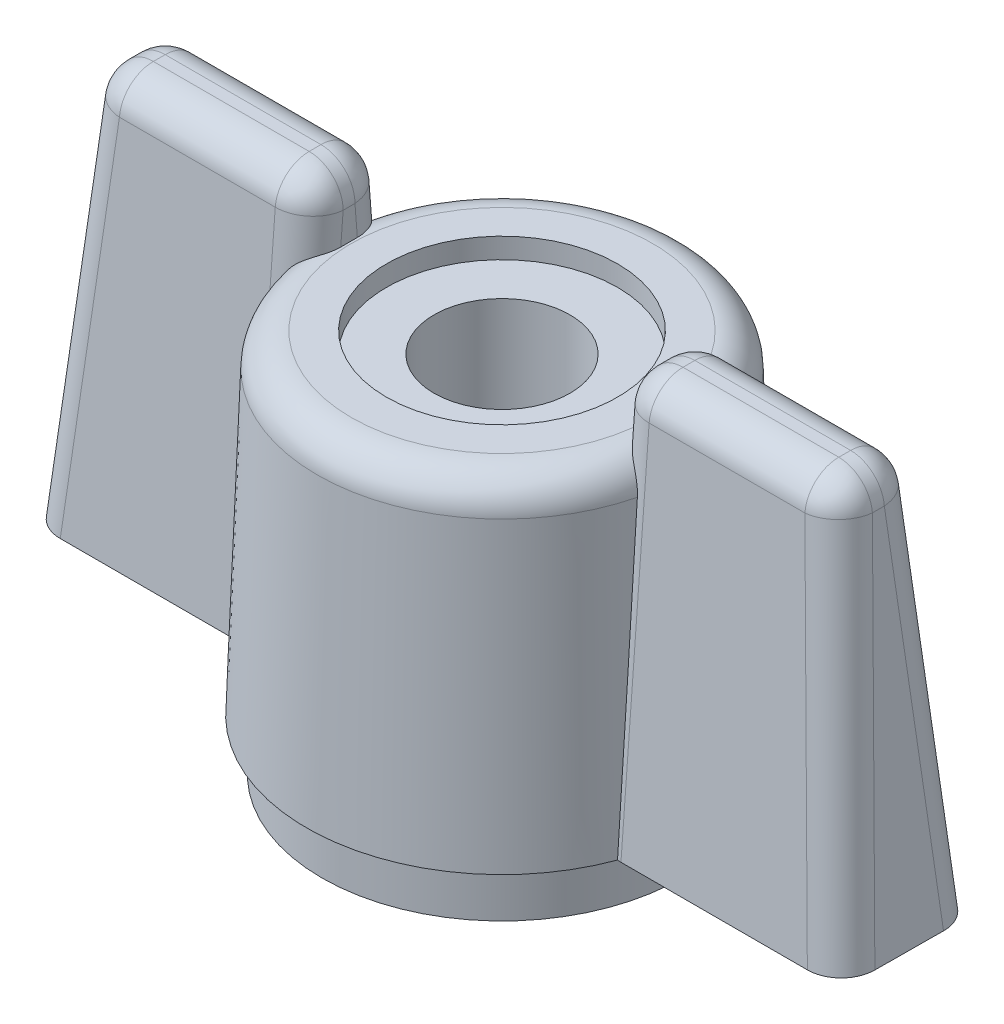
ISO-10303-21;
HEADER;
FILE_DESCRIPTION(('STEP AP214'),'2;1');
FILE_NAME('part.step','',(''),(''),'','','');
FILE_SCHEMA(('AUTOMOTIVE_DESIGN { 1 0 10303 214 1 1 1 1 }'));
ENDSEC;
DATA;
#1=APPLICATION_CONTEXT('core data for automotive mechanical design processes');
#2=APPLICATION_PROTOCOL_DEFINITION('international standard','automotive_design',2000,#1);
#3=PRODUCT_CONTEXT('',#1,'mechanical');
#4=PRODUCT('Part','Part','',(#3));
#5=PRODUCT_RELATED_PRODUCT_CATEGORY('part','',(#4));
#6=PRODUCT_DEFINITION_FORMATION('','',#4);
#7=PRODUCT_DEFINITION_CONTEXT('part definition',#1,'design');
#8=PRODUCT_DEFINITION('design','',#6,#7);
#9=PRODUCT_DEFINITION_SHAPE('','',#8);
#10=(LENGTH_UNIT() NAMED_UNIT(*) SI_UNIT(.MILLI.,.METRE.));
#11=(NAMED_UNIT(*) PLANE_ANGLE_UNIT() SI_UNIT($,.RADIAN.));
#12=(NAMED_UNIT(*) SI_UNIT($,.STERADIAN.) SOLID_ANGLE_UNIT());
#13=UNCERTAINTY_MEASURE_WITH_UNIT(LENGTH_MEASURE(1.E-05),#10,'distance_accuracy_value','');
#14=(GEOMETRIC_REPRESENTATION_CONTEXT(3) GLOBAL_UNCERTAINTY_ASSIGNED_CONTEXT((#13)) GLOBAL_UNIT_ASSIGNED_CONTEXT((#10,
#11,#12)) REPRESENTATION_CONTEXT('',''));
#15=CARTESIAN_POINT('',(0.,0.,0.));
#16=DIRECTION('',(0.,0.,1.));
#17=DIRECTION('',(1.,0.,0.));
#18=AXIS2_PLACEMENT_3D('',#15,#16,#17);
#19=CARTESIAN_POINT('',(0.,51.0351851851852,0.));
#20=DIRECTION('',(0.,1.,0.));
#21=DIRECTION('',(0.,0.,1.));
#22=AXIS2_PLACEMENT_3D('',#19,#20,#21);
#23=CYLINDRICAL_SURFACE('',#22,1.99999999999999);
#24=CARTESIAN_POINT('',(0.,0.,0.));
#25=DIRECTION('',(0.,1.,0.));
#26=DIRECTION('',(0.,0.,1.));
#27=AXIS2_PLACEMENT_3D('',#24,#25,#26);
#28=CIRCLE('',#27,1.99999999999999);
#29=CARTESIAN_POINT('',(0.,0.,1.99999999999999));
#30=VERTEX_POINT('',#29);
#31=EDGE_CURVE('E408',#30,#30,#28,.T.);
#32=ORIENTED_EDGE('',*,*,#31,.F.);
#33=EDGE_LOOP('',(#32));
#34=FACE_BOUND('',#33,.T.);
#35=CARTESIAN_POINT('',(0.,10.7,0.));
#36=DIRECTION('',(0.,1.,0.));
#37=DIRECTION('',(0.,0.,1.));
#38=AXIS2_PLACEMENT_3D('',#35,#36,#37);
#39=CIRCLE('',#38,1.99999999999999);
#40=CARTESIAN_POINT('',(0.,10.7,1.99999999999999));
#41=VERTEX_POINT('',#40);
#42=EDGE_CURVE('E42',#41,#41,#39,.T.);
#43=ORIENTED_EDGE('',*,*,#42,.T.);
#44=EDGE_LOOP('',(#43));
#45=FACE_BOUND('',#44,.T.);
#46=ADVANCED_FACE('F37',(#34,#45),#23,.F.);
#47=CARTESIAN_POINT('',(0.,10.3356915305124,0.));
#48=DIRECTION('',(0.,-1.,0.));
#49=DIRECTION('',(0.,0.,-1.));
#50=AXIS2_PLACEMENT_3D('',#47,#48,#49);
#51=CONICAL_SURFACE('',#50,5.43443958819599,0.0356991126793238);
#52=CARTESIAN_POINT('',(0.,1.5,0.));
#53=DIRECTION('',(0.,1.,0.));
#54=DIRECTION('',(0.,0.,1.));
#55=AXIS2_PLACEMENT_3D('',#52,#53,#54);
#56=CIRCLE('',#55,5.75);
#57=CARTESIAN_POINT('',(5.39309357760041,1.5,-1.99425215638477));
#58=VERTEX_POINT('',#57);
#59=CARTESIAN_POINT('',(-5.39309357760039,1.5,-1.99425215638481));
#60=VERTEX_POINT('',#59);
#61=EDGE_CURVE('E449',#58,#60,#56,.T.);
#62=ORIENTED_EDGE('',*,*,#61,.T.);
#63=CARTESIAN_POINT('',(-5.39309357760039,1.5,-1.99425215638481));
#64=CARTESIAN_POINT('',(-5.39001527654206,1.83231230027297,-1.96835808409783));
#65=CARTESIAN_POINT('',(-5.38679770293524,2.16462094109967,-1.94243427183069));
#66=CARTESIAN_POINT('',(-5.38008338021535,2.82922957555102,-1.89051976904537));
#67=CARTESIAN_POINT('',(-5.37658663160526,3.16152956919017,-1.86452907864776));
#68=CARTESIAN_POINT('',(-5.360468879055,4.63427175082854,-1.74917290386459));
#69=CARTESIAN_POINT('',(-5.34633983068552,5.77466663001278,-1.65940661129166));
#70=CARTESIAN_POINT('',(-5.31466978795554,8.05530657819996,-1.47849506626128));
#71=CARTESIAN_POINT('',(-5.29712877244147,9.19555164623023,-1.38734980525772));
#72=CARTESIAN_POINT('',(-5.27782383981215,10.3356915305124,-1.295264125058));
#73=B_SPLINE_CURVE_WITH_KNOTS('',3,(#63,#64,#65,#66,#67,#68,#69,#70,#71,#72),.UNSPECIFIED.,.F.,
.F.,(4,2,2,2,4),(0.,1.00000136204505,2.00000092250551,5.43202367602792,8.86406770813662),.UNSPECIFIED.);
#74=CARTESIAN_POINT('',(-5.27782383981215,10.3356915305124,-1.295264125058));
#75=VERTEX_POINT('',#74);
#76=EDGE_CURVE('E315',#60,#75,#73,.T.);
#77=ORIENTED_EDGE('',*,*,#76,.T.);
#78=CARTESIAN_POINT('',(0.,10.3356915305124,0.));
#79=DIRECTION('',(0.,1.,0.));
#80=DIRECTION('',(0.,0.,1.));
#81=AXIS2_PLACEMENT_3D('',#78,#79,#80);
#82=CIRCLE('',#81,5.43443958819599);
#83=CARTESIAN_POINT('',(5.27782383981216,10.3356915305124,-1.29526412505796));
#84=VERTEX_POINT('',#83);
#85=EDGE_CURVE('E62',#84,#75,#82,.T.);
#86=ORIENTED_EDGE('',*,*,#85,.F.);
#87=CARTESIAN_POINT('',(5.27782383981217,10.3356915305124,-1.29526412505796));
#88=CARTESIAN_POINT('',(5.2834533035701,10.0034877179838,-1.32210508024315));
#89=CARTESIAN_POINT('',(5.28893025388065,9.6712744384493,-1.34886026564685));
#90=CARTESIAN_POINT('',(5.29958480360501,9.00683143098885,-1.40221752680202));
#91=CARTESIAN_POINT('',(5.3047624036,8.67460170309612,-1.42881960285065));
#92=CARTESIAN_POINT('',(5.32705890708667,7.20211811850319,-1.54642239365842));
#93=CARTESIAN_POINT('',(5.34259519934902,6.06178205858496,-1.63669782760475));
#94=CARTESIAN_POINT('',(5.37032376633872,3.78097612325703,-1.81616385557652));
#95=CARTESIAN_POINT('',(5.38251601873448,2.64050624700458,-1.90535444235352));
#96=CARTESIAN_POINT('',(5.3930935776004,1.5,-1.99425215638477));
#97=B_SPLINE_CURVE_WITH_KNOTS('',3,(#87,#88,#89,#90,#91,#92,#93,#94,#95,#96),.UNSPECIFIED.,.F.,
.F.,(4,2,2,2,4),(0.,1.00000162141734,2.00000130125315,5.43202316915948,8.86406795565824),.UNSPECIFIED.);
#98=EDGE_CURVE('E308',#84,#58,#97,.T.);
#99=ORIENTED_EDGE('',*,*,#98,.T.);
#100=EDGE_LOOP('',(#62,#77,#86,#99));
#101=FACE_BOUND('',#100,.T.);
#102=ADVANCED_FACE('F294',(#101),#51,.T.);
#103=CARTESIAN_POINT('',(-5.27782383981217,10.3356915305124,1.29526412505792));
#104=VERTEX_POINT('',#103);
#105=CARTESIAN_POINT('',(5.27782383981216,10.3356915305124,1.29526412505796));
#106=VERTEX_POINT('',#105);
#107=EDGE_CURVE('E54',#104,#106,#82,.T.);
#108=ORIENTED_EDGE('',*,*,#107,.F.);
#109=CARTESIAN_POINT('',(-5.27782383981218,10.3356915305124,1.29526412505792));
#110=CARTESIAN_POINT('',(-5.28345330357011,10.0034877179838,1.32210508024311));
#111=CARTESIAN_POINT('',(-5.28893025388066,9.6712744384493,1.34886026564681));
#112=CARTESIAN_POINT('',(-5.29958480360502,9.00683143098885,1.40221752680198));
#113=CARTESIAN_POINT('',(-5.30476240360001,8.67460170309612,1.42881960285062));
#114=CARTESIAN_POINT('',(-5.32705890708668,7.20211811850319,1.54642239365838));
#115=CARTESIAN_POINT('',(-5.34259519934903,6.06178205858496,1.63669782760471));
#116=CARTESIAN_POINT('',(-5.37032376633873,3.78097612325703,1.81616385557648));
#117=CARTESIAN_POINT('',(-5.38251601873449,2.64050624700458,1.90535444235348));
#118=CARTESIAN_POINT('',(-5.39309357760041,1.5,1.99425215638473));
#119=B_SPLINE_CURVE_WITH_KNOTS('',3,(#109,#110,#111,#112,#113,#114,#115,#116,#117,#118),
.UNSPECIFIED.,.F.,.F.,(4,2,2,2,4),(0.,1.00000162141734,2.00000130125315,5.43202316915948,
8.86406795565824),.UNSPECIFIED.);
#120=CARTESIAN_POINT('',(-5.39309357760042,1.5,1.99425215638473));
#121=VERTEX_POINT('',#120);
#122=EDGE_CURVE('E11',#104,#121,#119,.T.);
#123=ORIENTED_EDGE('',*,*,#122,.T.);
#124=CARTESIAN_POINT('',(5.39309357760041,1.5,1.99425215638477));
#125=VERTEX_POINT('',#124);
#126=EDGE_CURVE('E448',#121,#125,#56,.T.);
#127=ORIENTED_EDGE('',*,*,#126,.T.);
#128=CARTESIAN_POINT('',(5.39309357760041,1.5,1.99425215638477));
#129=CARTESIAN_POINT('',(5.39001527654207,1.83231230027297,1.96835808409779));
#130=CARTESIAN_POINT('',(5.38679770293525,2.16462094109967,1.94243427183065));
#131=CARTESIAN_POINT('',(5.38008338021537,2.82922957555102,1.89051976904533));
#132=CARTESIAN_POINT('',(5.37658663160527,3.16152956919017,1.86452907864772));
#133=CARTESIAN_POINT('',(5.36046887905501,4.63427175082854,1.74917290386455));
#134=CARTESIAN_POINT('',(5.34633983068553,5.77466663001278,1.65940661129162));
#135=CARTESIAN_POINT('',(5.31466978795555,8.05530657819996,1.47849506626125));
#136=CARTESIAN_POINT('',(5.29712877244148,9.19555164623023,1.38734980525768));
#137=CARTESIAN_POINT('',(5.27782383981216,10.3356915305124,1.29526412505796));
#138=B_SPLINE_CURVE_WITH_KNOTS('',3,(#128,#129,#130,#131,#132,#133,#134,#135,#136,#137),
.UNSPECIFIED.,.F.,.F.,(4,2,2,2,4),(0.,1.00000136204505,2.00000092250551,5.43202367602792,
8.86406770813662),.UNSPECIFIED.);
#139=EDGE_CURVE('E277',#125,#106,#138,.T.);
#140=ORIENTED_EDGE('',*,*,#139,.T.);
#141=EDGE_LOOP('',(#108,#123,#127,#140));
#142=FACE_BOUND('',#141,.T.);
#143=ADVANCED_FACE('F298',(#142),#51,.T.);
#144=CARTESIAN_POINT('',(0.,10.3,0.));
#145=DIRECTION('',(0.,1.,0.));
#146=DIRECTION('',(0.,0.,1.));
#147=AXIS2_PLACEMENT_3D('',#144,#145,#146);
#148=TOROIDAL_SURFACE('',#147,4.43507673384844,1.);
#149=CARTESIAN_POINT('',(0.,11.3,0.));
#150=DIRECTION('',(0.,1.,0.));
#151=DIRECTION('',(0.,0.,1.));
#152=AXIS2_PLACEMENT_3D('',#149,#150,#151);
#153=CIRCLE('',#152,4.43507673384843);
#154=CARTESIAN_POINT('',(0.,11.3,4.43507673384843));
#155=VERTEX_POINT('',#154);
#156=EDGE_CURVE('E444',#155,#155,#153,.T.);
#157=ORIENTED_EDGE('',*,*,#156,.F.);
#158=EDGE_LOOP('',(#157));
#159=FACE_BOUND('',#158,.T.);
#160=ORIENTED_EDGE('',*,*,#85,.T.);
#161=CARTESIAN_POINT('',(-5.27782383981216,10.3356915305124,-1.295264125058));
#162=CARTESIAN_POINT('',(-5.27735411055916,10.3636970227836,-1.29299359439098));
#163=CARTESIAN_POINT('',(-5.27572512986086,10.3916617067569,-1.29047849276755));
#164=CARTESIAN_POINT('',(-5.27019000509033,10.4473095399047,-1.28490838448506));
#165=CARTESIAN_POINT('',(-5.2662839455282,10.4749926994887,-1.28185339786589));
#166=CARTESIAN_POINT('',(-5.25623081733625,10.5299077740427,-1.27514916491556));
#167=CARTESIAN_POINT('',(-5.25008145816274,10.5571391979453,-1.27149931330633));
#168=CARTESIAN_POINT('',(-5.23562799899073,10.6109111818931,-1.26350518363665));
#169=CARTESIAN_POINT('',(-5.22732392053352,10.6374517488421,-1.25916091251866));
#170=CARTESIAN_POINT('',(-5.19930602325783,10.7157921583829,-1.24487919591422));
#171=CARTESIAN_POINT('',(-5.17648772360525,10.7663043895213,-1.23369355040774));
#172=CARTESIAN_POINT('',(-5.12387093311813,10.8621120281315,-1.20661139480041));
#173=CARTESIAN_POINT('',(-5.0940780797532,10.9074116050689,-1.1907186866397));
#174=CARTESIAN_POINT('',(-5.03041603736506,10.9899445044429,-1.15323338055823));
#175=CARTESIAN_POINT('',(-4.99670596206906,11.0273879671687,-1.13183738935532));
#176=CARTESIAN_POINT('',(-4.92698094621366,11.0946380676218,-1.08199880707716));
#177=CARTESIAN_POINT('',(-4.89096895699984,11.1244542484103,-1.05356510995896));
#178=CARTESIAN_POINT('',(-4.82384732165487,11.1728568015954,-0.993071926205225));
#179=CARTESIAN_POINT('',(-4.79265587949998,11.1923474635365,-0.961822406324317));
#180=CARTESIAN_POINT('',(-4.73297937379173,11.2252011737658,-0.893991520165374));
#181=CARTESIAN_POINT('',(-4.70449402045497,11.2385648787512,-0.857410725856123));
#182=CARTESIAN_POINT('',(-4.65300029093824,11.2597025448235,-0.781315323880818));
#183=CARTESIAN_POINT('',(-4.62982428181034,11.2676705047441,-0.741966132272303));
#184=CARTESIAN_POINT('',(-4.58864313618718,11.2800441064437,-0.660063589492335));
#185=CARTESIAN_POINT('',(-4.57064537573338,11.2844446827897,-0.617505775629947));
#186=CARTESIAN_POINT('',(-4.54644402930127,11.2896373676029,-0.547392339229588));
#187=CARTESIAN_POINT('',(-4.53838453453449,11.2911679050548,-0.520509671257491));
#188=CARTESIAN_POINT('',(-4.52450625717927,11.293610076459,-0.466132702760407));
#189=CARTESIAN_POINT('',(-4.51868800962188,11.2945215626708,-0.438638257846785));
#190=CARTESIAN_POINT('',(-4.50936418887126,11.2959263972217,-0.383281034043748));
#191=CARTESIAN_POINT('',(-4.50585621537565,11.2964201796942,-0.355418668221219));
#192=CARTESIAN_POINT('',(-4.50117276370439,11.2971169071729,-0.299503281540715));
#193=CARTESIAN_POINT('',(-4.49999659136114,11.2973199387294,-0.271450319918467));
#194=CARTESIAN_POINT('',(-4.5,11.2974405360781,-0.243396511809));
#195=B_SPLINE_CURVE_WITH_KNOTS('',3,(#161,#162,#163,#164,#165,#166,#167,#168,#169,#170,#171,
#172,#173,#174,#175,#176,#177,#178,#179,#180,#181,#182,#183,#184,#185,#186,#187,#188,#189,#190,
#191,#192,#193,#194),.UNSPECIFIED.,.F.,.F.,(4,2,2,2,2,2,2,2,2,2,2,2,2,2,2,2,4),(0.,
0.0842765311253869,0.168549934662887,0.252909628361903,0.337268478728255,0.506005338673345,
0.674606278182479,0.837863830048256,1.00091610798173,1.14494651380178,1.28896147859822,
1.42747597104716,1.56618680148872,1.65041584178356,1.73466497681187,1.81882644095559,
1.90296284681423),.UNSPECIFIED.);
#196=CARTESIAN_POINT('',(-4.5,11.2974405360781,-0.243396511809));
#197=VERTEX_POINT('',#196);
#198=EDGE_CURVE('E322',#75,#197,#195,.T.);
#199=ORIENTED_EDGE('',*,*,#198,.T.);
#200=CARTESIAN_POINT('',(-4.5,11.2978902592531,0.));
#201=CARTESIAN_POINT('',(-4.5,11.2978905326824,0.0838283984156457));
#202=CARTESIAN_POINT('',(-4.5,11.2977461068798,0.167656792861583));
#203=CARTESIAN_POINT('',(-4.5,11.2970710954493,0.335313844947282));
#204=CARTESIAN_POINT('',(-4.5,11.2965405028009,0.419142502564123));
#205=CARTESIAN_POINT('',(-4.5,11.2948009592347,0.586900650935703));
#206=CARTESIAN_POINT('',(-4.5,11.2935911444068,0.67083013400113));
#207=CARTESIAN_POINT('',(-4.50000000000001,11.29001446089,0.838663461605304));
#208=CARTESIAN_POINT('',(-4.50000000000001,11.2876476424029,0.922567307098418));
#209=CARTESIAN_POINT('',(-4.50000000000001,11.2811130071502,1.08992993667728));
#210=CARTESIAN_POINT('',(-4.50000000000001,11.2769533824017,1.17338901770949));
#211=CARTESIAN_POINT('',(-4.50000000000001,11.2660060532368,1.3401321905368));
#212=CARTESIAN_POINT('',(-4.50000000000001,11.2592187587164,1.42341630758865));
#213=CARTESIAN_POINT('',(-4.50000000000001,11.2420101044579,1.58942652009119));
#214=CARTESIAN_POINT('',(-4.50000000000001,11.2315972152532,1.67215346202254));
#215=CARTESIAN_POINT('',(-4.50000000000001,11.2058895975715,1.83683018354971));
#216=CARTESIAN_POINT('',(-4.50000000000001,11.1905980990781,1.9187804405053));
#217=CARTESIAN_POINT('',(-4.50000000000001,11.1625210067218,2.04196700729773));
#218=CARTESIAN_POINT('',(-4.50000000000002,11.1520959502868,2.08373892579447));
#219=CARTESIAN_POINT('',(-4.50000000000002,11.1292621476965,2.16674401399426));
#220=CARTESIAN_POINT('',(-4.50000000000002,11.1168527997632,2.20797701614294));
#221=CARTESIAN_POINT('',(-4.50000000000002,11.0762262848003,2.33058417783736));
#222=CARTESIAN_POINT('',(-4.50000000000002,11.0446006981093,2.4109132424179));
#223=CARTESIAN_POINT('',(-4.50000000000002,10.9787831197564,2.54690570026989));
#224=CARTESIAN_POINT('',(-4.50000000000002,10.9471265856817,2.60378361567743));
#225=CARTESIAN_POINT('',(-4.50000000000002,10.8757080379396,2.71226787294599));
#226=CARTESIAN_POINT('',(-4.50000000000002,10.8359627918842,2.76388479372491));
#227=CARTESIAN_POINT('',(-4.50000000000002,10.762806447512,2.84182378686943));
#228=CARTESIAN_POINT('',(-4.50000000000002,10.7320844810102,2.87065708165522));
#229=CARTESIAN_POINT('',(-4.50000000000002,10.666605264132,2.92333738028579));
#230=CARTESIAN_POINT('',(-4.50000000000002,10.6318536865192,2.94719126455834));
#231=CARTESIAN_POINT('',(-4.50000000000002,10.5650918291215,2.98466254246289));
#232=CARTESIAN_POINT('',(-4.50000000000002,10.5336834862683,2.99934417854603));
#233=CARTESIAN_POINT('',(-4.50000000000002,10.4688518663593,3.02329115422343));
#234=CARTESIAN_POINT('',(-4.50000000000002,10.4354299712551,3.03256016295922));
#235=CARTESIAN_POINT('',(-4.50000000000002,10.3672613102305,3.0449782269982));
#236=CARTESIAN_POINT('',(-4.50000000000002,10.3325083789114,3.04809405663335));
#237=CARTESIAN_POINT('',(-4.50000000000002,10.2630291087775,3.04781671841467));
#238=CARTESIAN_POINT('',(-4.50000000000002,10.2283027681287,3.04442404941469));
#239=CARTESIAN_POINT('',(-4.50000000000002,10.1629889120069,3.03200627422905));
#240=CARTESIAN_POINT('',(-4.50000000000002,10.1323020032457,3.02348966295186));
#241=CARTESIAN_POINT('',(-4.50000000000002,10.0726090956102,3.00186988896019));
#242=CARTESIAN_POINT('',(-4.50000000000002,10.0436034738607,2.98876570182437));
#243=CARTESIAN_POINT('',(-4.50000000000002,9.97669913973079,2.9527705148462));
#244=CARTESIAN_POINT('',(-4.50000000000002,9.9397819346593,2.92805710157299));
#245=CARTESIAN_POINT('',(-4.50000000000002,9.87038484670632,2.87301420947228));
#246=CARTESIAN_POINT('',(-4.50000000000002,9.83791670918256,2.84267034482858));
#247=CARTESIAN_POINT('',(-4.50000000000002,9.76171837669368,2.76129635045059));
#248=CARTESIAN_POINT('',(-4.50000000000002,9.72079337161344,2.70765778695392));
#249=CARTESIAN_POINT('',(-4.50000000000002,9.64757958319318,2.59494601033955));
#250=CARTESIAN_POINT('',(-4.50000000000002,9.61529742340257,2.53586867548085));
#251=CARTESIAN_POINT('',(-4.50000000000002,9.56005643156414,2.41915227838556));
#252=CARTESIAN_POINT('',(-4.50000000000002,9.53656796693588,2.36175832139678));
#253=CARTESIAN_POINT('',(-4.50000000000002,9.49455741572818,2.24515167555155));
#254=CARTESIAN_POINT('',(-4.50000000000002,9.47604020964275,2.18593726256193));
#255=CARTESIAN_POINT('',(-4.50000000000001,9.44301850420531,2.06606005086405));
#256=CARTESIAN_POINT('',(-4.50000000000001,9.42853735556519,2.00539094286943));
#257=CARTESIAN_POINT('',(-4.50000000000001,9.40298347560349,1.88340602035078));
#258=CARTESIAN_POINT('',(-4.50000000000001,9.39190793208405,1.82209078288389));
#259=CARTESIAN_POINT('',(-4.50000000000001,9.37092856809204,1.68900272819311));
#260=CARTESIAN_POINT('',(-4.50000000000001,9.36151016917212,1.61715473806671));
#261=CARTESIAN_POINT('',(-4.50000000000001,9.34556103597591,1.47313275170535));
#262=CARTESIAN_POINT('',(-4.50000000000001,9.33903102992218,1.40095867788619));
#263=CARTESIAN_POINT('',(-4.50000000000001,9.32268182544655,1.18405037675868));
#264=CARTESIAN_POINT('',(-4.50000000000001,9.3161238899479,1.03908041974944));
#265=CARTESIAN_POINT('',(-4.50000000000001,9.30736586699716,0.748355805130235));
#266=CARTESIAN_POINT('',(-4.5,9.30518717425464,0.602600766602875));
#267=CARTESIAN_POINT('',(-4.5,9.30258214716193,0.311179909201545));
#268=CARTESIAN_POINT('',(-4.5,9.30215457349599,0.165514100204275));
#269=CARTESIAN_POINT('',(-4.5,9.30207050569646,-0.126164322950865));
#270=CARTESIAN_POINT('',(-4.5,9.30241584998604,-0.272176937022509));
#271=CARTESIAN_POINT('',(-4.5,9.30470617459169,-0.564289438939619));
#272=CARTESIAN_POINT('',(-4.5,9.30665223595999,-0.710389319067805));
#273=CARTESIAN_POINT('',(-4.49999999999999,9.31467116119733,-1.00183170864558));
#274=CARTESIAN_POINT('',(-4.49999999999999,9.32072441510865,-1.14717452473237));
#275=CARTESIAN_POINT('',(-4.49999999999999,9.3360295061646,-1.36469967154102));
#276=CARTESIAN_POINT('',(-4.49999999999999,9.34216422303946,-1.43709129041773));
#277=CARTESIAN_POINT('',(-4.49999999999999,9.35721245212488,-1.58157922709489));
#278=CARTESIAN_POINT('',(-4.49999999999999,9.36612537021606,-1.65367560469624));
#279=CARTESIAN_POINT('',(-4.49999999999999,9.38761963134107,-1.797852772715));
#280=CARTESIAN_POINT('',(-4.49999999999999,9.40022629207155,-1.86992989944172));
#281=CARTESIAN_POINT('',(-4.49999999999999,9.4301147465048,-2.01322346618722));
#282=CARTESIAN_POINT('',(-4.49999999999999,9.44740198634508,-2.08443880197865));
#283=CARTESIAN_POINT('',(-4.49999999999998,9.48772159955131,-2.22465072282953));
#284=CARTESIAN_POINT('',(-4.49999999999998,9.51070694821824,-2.29366049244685));
#285=CARTESIAN_POINT('',(-4.49999999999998,9.56394760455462,-2.42876033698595));
#286=CARTESIAN_POINT('',(-4.49999999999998,9.59418961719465,-2.49485549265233));
#287=CARTESIAN_POINT('',(-4.49999999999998,9.66418909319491,-2.62306600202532));
#288=CARTESIAN_POINT('',(-4.49999999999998,9.70406704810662,-2.68511720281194));
#289=CARTESIAN_POINT('',(-4.49999999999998,9.79512114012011,-2.80036392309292));
#290=CARTESIAN_POINT('',(-4.49999999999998,9.8462382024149,-2.85360328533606));
#291=CARTESIAN_POINT('',(-4.49999999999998,9.931422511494,-2.92154758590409));
#292=CARTESIAN_POINT('',(-4.49999999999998,9.96087184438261,-2.9420495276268));
#293=CARTESIAN_POINT('',(-4.49999999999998,10.0225374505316,-2.97840789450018));
#294=CARTESIAN_POINT('',(-4.49999999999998,10.0547519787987,-2.99426722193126));
#295=CARTESIAN_POINT('',(-4.49999999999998,10.121726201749,-3.02039976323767));
#296=CARTESIAN_POINT('',(-4.49999999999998,10.1565051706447,-3.0306244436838));
#297=CARTESIAN_POINT('',(-4.49999999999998,10.2273669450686,-3.04438574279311));
#298=CARTESIAN_POINT('',(-4.49999999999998,10.2634487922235,-3.04792717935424));
#299=CARTESIAN_POINT('',(-4.49999999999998,10.3323776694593,-3.04798917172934));
#300=CARTESIAN_POINT('',(-4.49999999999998,10.365225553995,-3.04510900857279));
#301=CARTESIAN_POINT('',(-4.49999999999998,10.4299374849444,-3.03377393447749));
#302=CARTESIAN_POINT('',(-4.49999999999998,10.4618013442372,-3.02531797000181));
#303=CARTESIAN_POINT('',(-4.49999999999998,10.5233321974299,-3.00359981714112));
#304=CARTESIAN_POINT('',(-4.49999999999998,10.5530231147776,-2.99040432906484));
#305=CARTESIAN_POINT('',(-4.49999999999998,10.6102294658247,-2.95996336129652));
#306=CARTESIAN_POINT('',(-4.49999999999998,10.6377439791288,-2.94271618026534));
#307=CARTESIAN_POINT('',(-4.49999999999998,10.7056131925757,-2.89402078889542));
#308=CARTESIAN_POINT('',(-4.49999999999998,10.7442110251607,-2.86012226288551));
#309=CARTESIAN_POINT('',(-4.49999999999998,10.8155897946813,-2.78667884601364));
#310=CARTESIAN_POINT('',(-4.49999999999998,10.8483551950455,-2.74711936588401));
#311=CARTESIAN_POINT('',(-4.49999999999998,10.9273441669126,-2.63842225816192));
#312=CARTESIAN_POINT('',(-4.49999999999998,10.9692700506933,-2.566186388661));
#313=CARTESIAN_POINT('',(-4.49999999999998,11.0420953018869,-2.41645143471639));
#314=CARTESIAN_POINT('',(-4.49999999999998,11.0729688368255,-2.33894051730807));
#315=CARTESIAN_POINT('',(-4.49999999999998,11.1350284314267,-2.15486136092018));
#316=CARTESIAN_POINT('',(-4.49999999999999,11.162904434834,-2.04720166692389));
#317=CARTESIAN_POINT('',(-4.49999999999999,11.2080728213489,-1.82961675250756));
#318=CARTESIAN_POINT('',(-4.49999999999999,11.2253411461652,-1.71968696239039));
#319=CARTESIAN_POINT('',(-4.49999999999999,11.252626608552,-1.49851328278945));
#320=CARTESIAN_POINT('',(-4.49999999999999,11.2626129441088,-1.38726581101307));
#321=CARTESIAN_POINT('',(-4.49999999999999,11.2777833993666,-1.16457520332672));
#322=CARTESIAN_POINT('',(-4.49999999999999,11.2829716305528,-1.05313231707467));
#323=CARTESIAN_POINT('',(-4.49999999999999,11.2893698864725,-0.863171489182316));
#324=CARTESIAN_POINT('',(-4.49999999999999,11.291302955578,-0.784674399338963));
#325=CARTESIAN_POINT('',(-4.5,11.2942461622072,-0.627662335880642));
#326=CARTESIAN_POINT('',(-4.5,11.2952562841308,-0.549147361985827));
#327=CARTESIAN_POINT('',(-4.5,11.29672268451,-0.392184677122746));
#328=CARTESIAN_POINT('',(-4.5,11.2971794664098,-0.313736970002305));
#329=CARTESIAN_POINT('',(-4.5,11.2977630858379,-0.156859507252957));
#330=CARTESIAN_POINT('',(-4.5,11.297890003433,-0.0784297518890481));
#331=CARTESIAN_POINT('',(-4.5,11.2978902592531,0.));
#332=B_SPLINE_CURVE_WITH_KNOTS('',3,(#200,#201,#202,#203,#204,#205,#206,#207,#208,#209,#210,
#211,#212,#213,#214,#215,#216,#217,#218,#219,#220,#221,#222,#223,#224,#225,#226,#227,#228,#229,
#230,#231,#232,#233,#234,#235,#236,#237,#238,#239,#240,#241,#242,#243,#244,#245,#246,#247,#248,
#249,#250,#251,#252,#253,#254,#255,#256,#257,#258,#259,#260,#261,#262,#263,#264,#265,#266,#267,
#268,#269,#270,#271,#272,#273,#274,#275,#276,#277,#278,#279,#280,#281,#282,#283,#284,#285,#286,
#287,#288,#289,#290,#291,#292,#293,#294,#295,#296,#297,#298,#299,#300,#301,#302,#303,#304,#305,
#306,#307,#308,#309,#310,#311,#312,#313,#314,#315,#316,#317,#318,#319,#320,#321,#322,#323,#324,
#325,#326,#327,#328,#329,#330,#331),.UNSPECIFIED.,.T.,.F.,(4,2,2,2,2,2,2,2,2,2,2,2,2,2,2,2,2,2,
2,2,2,2,2,2,2,2,2,2,2,2,2,2,2,2,2,2,2,2,2,2,2,2,2,2,2,2,2,2,2,2,2,2,2,2,2,2,2,2,2,2,2,2,2,2,2,
4),(0.,0.25148501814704,0.502974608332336,0.754784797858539,1.0065840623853,1.25724475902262,
1.50786637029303,1.7579063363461,2.00778110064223,2.13689403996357,2.26604621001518,
2.52420774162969,2.71900027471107,2.91339304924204,3.03941206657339,3.16525578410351,
3.26884604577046,3.37236600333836,3.47644343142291,3.58051288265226,3.67564888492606,
3.77080614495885,3.90333694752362,4.03621114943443,4.2374783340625,4.43889932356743,
4.62466490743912,4.81061220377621,4.99761396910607,5.18446089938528,5.40177030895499,
5.61913447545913,6.05431709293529,6.4916206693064,6.92861470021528,7.36664924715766,
7.80497986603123,8.24123224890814,8.45914560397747,8.67701239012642,8.89640888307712,
9.11606176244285,9.33395897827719,9.55145998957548,9.77183593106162,9.9910801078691,
10.098398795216,10.2056502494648,10.313811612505,10.4218949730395,10.5203170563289,
10.6187577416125,10.715864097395,10.8130113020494,10.96623953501,11.119870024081,
11.3690151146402,11.6187387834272,11.9515043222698,12.2850218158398,12.6199419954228,
12.9545749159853,13.1901316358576,13.4256923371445,13.6610385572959,13.8963276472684),.UNSPECIFIED.);
#333=CARTESIAN_POINT('',(-4.5,11.2974405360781,0.243396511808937));
#334=VERTEX_POINT('',#333);
#335=EDGE_CURVE('E604',#197,#334,#332,.T.);
#336=ORIENTED_EDGE('',*,*,#335,.T.);
#337=CARTESIAN_POINT('',(-4.5,11.2974405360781,0.243396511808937));
#338=CARTESIAN_POINT('',(-4.49999705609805,11.2973232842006,0.270845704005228));
#339=CARTESIAN_POINT('',(-4.50112282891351,11.2971261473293,0.298293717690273));
#340=CARTESIAN_POINT('',(-4.50560618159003,11.2964560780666,0.353006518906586));
#341=CARTESIAN_POINT('',(-4.50896401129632,11.2959831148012,0.380271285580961));
#342=CARTESIAN_POINT('',(-4.51790221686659,11.2946428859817,0.434529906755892));
#343=CARTESIAN_POINT('',(-4.52349070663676,11.2937741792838,0.46152239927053));
#344=CARTESIAN_POINT('',(-4.53682810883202,11.2914538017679,0.514933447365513));
#345=CARTESIAN_POINT('',(-4.54457693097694,11.2900021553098,0.54135202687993));
#346=CARTESIAN_POINT('',(-4.57100388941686,11.2844280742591,0.619594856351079));
#347=CARTESIAN_POINT('',(-4.59284786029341,11.2790872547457,0.670318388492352));
#348=CARTESIAN_POINT('',(-4.64375069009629,11.2630507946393,0.766937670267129));
#349=CARTESIAN_POINT('',(-4.67279028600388,11.2523693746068,0.812845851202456));
#350=CARTESIAN_POINT('',(-4.73389895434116,11.2246931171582,0.895454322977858));
#351=CARTESIAN_POINT('',(-4.76562150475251,11.2081839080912,0.93257107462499));
#352=CARTESIAN_POINT('',(-4.83122942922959,11.1679443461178,1.00045157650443));
#353=CARTESIAN_POINT('',(-4.86511463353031,11.1442145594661,1.03121582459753));
#354=CARTESIAN_POINT('',(-4.92894356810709,11.0923928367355,1.08338189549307));
#355=CARTESIAN_POINT('',(-4.95893685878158,11.0649925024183,1.1054185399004));
#356=CARTESIAN_POINT('',(-5.0167849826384,11.0049715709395,1.14463255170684));
#357=CARTESIAN_POINT('',(-5.044639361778,10.9723498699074,1.16180888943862));
#358=CARTESIAN_POINT('',(-5.09809395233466,10.9009611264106,1.19278536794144));
#359=CARTESIAN_POINT('',(-5.12351454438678,10.8619699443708,1.20637651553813));
#360=CARTESIAN_POINT('',(-5.16927810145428,10.7801021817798,1.23002690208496));
#361=CARTESIAN_POINT('',(-5.18961647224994,10.7372221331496,1.24008294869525));
#362=CARTESIAN_POINT('',(-5.22637240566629,10.6434681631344,1.25859482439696));
#363=CARTESIAN_POINT('',(-5.24206038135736,10.5922441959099,1.26672921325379));
#364=CARTESIAN_POINT('',(-5.26524906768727,10.4877509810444,1.28068410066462));
#365=CARTESIAN_POINT('',(-5.27276517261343,10.4344857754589,1.28650893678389));
#366=CARTESIAN_POINT('',(-5.27698002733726,10.3658698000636,1.29274755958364));
#367=CARTESIAN_POINT('',(-5.27757091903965,10.3507833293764,1.29404154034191));
#368=CARTESIAN_POINT('',(-5.2778238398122,10.3356915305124,1.29526412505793));
#369=B_SPLINE_CURVE_WITH_KNOTS('',3,(#337,#338,#339,#340,#341,#342,#343,#344,#345,#346,#347,
#348,#349,#350,#351,#352,#353,#354,#355,#356,#357,#358,#359,#360,#361,#362,#363,#364,#365,#366,
#367,#368),.UNSPECIFIED.,.F.,.F.,(4,2,2,2,2,2,2,2,2,2,2,2,2,2,2,4),(0.,0.0823234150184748,
0.164656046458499,0.247290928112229,0.329922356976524,0.495448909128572,0.660537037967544,
0.814252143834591,0.967955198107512,1.10598425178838,1.24404252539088,1.38892883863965,
1.53394565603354,1.69580288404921,1.85735467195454,1.90279775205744),.UNSPECIFIED.);
#370=EDGE_CURVE('E47',#334,#104,#369,.T.);
#371=ORIENTED_EDGE('',*,*,#370,.T.);
#372=ORIENTED_EDGE('',*,*,#107,.T.);
#373=CARTESIAN_POINT('',(5.27782383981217,10.3356915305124,1.29526412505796));
#374=CARTESIAN_POINT('',(5.27735411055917,10.3636970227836,1.29299359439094));
#375=CARTESIAN_POINT('',(5.27572512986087,10.3916617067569,1.29047849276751));
#376=CARTESIAN_POINT('',(5.27019000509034,10.4473095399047,1.28490838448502));
#377=CARTESIAN_POINT('',(5.26628394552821,10.4749926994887,1.28185339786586));
#378=CARTESIAN_POINT('',(5.25623081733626,10.5299077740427,1.27514916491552));
#379=CARTESIAN_POINT('',(5.25008145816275,10.5571391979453,1.27149931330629));
#380=CARTESIAN_POINT('',(5.23562799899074,10.6109111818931,1.26350518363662));
#381=CARTESIAN_POINT('',(5.22732392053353,10.6374517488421,1.25916091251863));
#382=CARTESIAN_POINT('',(5.19930602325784,10.7157921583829,1.24487919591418));
#383=CARTESIAN_POINT('',(5.17648772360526,10.7663043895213,1.23369355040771));
#384=CARTESIAN_POINT('',(5.12387093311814,10.8621120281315,1.20661139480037));
#385=CARTESIAN_POINT('',(5.09407807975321,10.9074116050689,1.19071868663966));
#386=CARTESIAN_POINT('',(5.03041603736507,10.9899445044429,1.1532333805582));
#387=CARTESIAN_POINT('',(4.99670596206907,11.0273879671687,1.13183738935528));
#388=CARTESIAN_POINT('',(4.92698094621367,11.0946380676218,1.08199880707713));
#389=CARTESIAN_POINT('',(4.89096895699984,11.1244542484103,1.05356510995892));
#390=CARTESIAN_POINT('',(4.82384732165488,11.1728568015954,0.993071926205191));
#391=CARTESIAN_POINT('',(4.79265587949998,11.1923474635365,0.961822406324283));
#392=CARTESIAN_POINT('',(4.73297937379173,11.2252011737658,0.89399152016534));
#393=CARTESIAN_POINT('',(4.70449402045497,11.2385648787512,0.85741072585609));
#394=CARTESIAN_POINT('',(4.65300029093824,11.2597025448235,0.781315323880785));
#395=CARTESIAN_POINT('',(4.62982428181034,11.2676705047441,0.74196613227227));
#396=CARTESIAN_POINT('',(4.58864313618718,11.2800441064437,0.660063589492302));
#397=CARTESIAN_POINT('',(4.57064537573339,11.2844446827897,0.617505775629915));
#398=CARTESIAN_POINT('',(4.54644402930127,11.2896373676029,0.547392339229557));
#399=CARTESIAN_POINT('',(4.53838453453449,11.2911679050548,0.520509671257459));
#400=CARTESIAN_POINT('',(4.52450625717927,11.293610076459,0.466132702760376));
#401=CARTESIAN_POINT('',(4.51868800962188,11.2945215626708,0.438638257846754));
#402=CARTESIAN_POINT('',(4.50936418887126,11.2959263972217,0.383281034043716));
#403=CARTESIAN_POINT('',(4.50585621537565,11.2964201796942,0.355418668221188));
#404=CARTESIAN_POINT('',(4.50117276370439,11.2971169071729,0.299503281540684));
#405=CARTESIAN_POINT('',(4.49999659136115,11.2973199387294,0.271450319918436));
#406=CARTESIAN_POINT('',(4.5,11.2974405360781,0.243396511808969));
#407=B_SPLINE_CURVE_WITH_KNOTS('',3,(#373,#374,#375,#376,#377,#378,#379,#380,#381,#382,#383,
#384,#385,#386,#387,#388,#389,#390,#391,#392,#393,#394,#395,#396,#397,#398,#399,#400,#401,#402,
#403,#404,#405,#406),.UNSPECIFIED.,.F.,.F.,(4,2,2,2,2,2,2,2,2,2,2,2,2,2,2,2,4),(0.,
0.0842765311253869,0.168549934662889,0.252909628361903,0.337268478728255,0.506005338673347,
0.674606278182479,0.837863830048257,1.00091610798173,1.14494651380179,1.28896147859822,
1.42747597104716,1.56618680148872,1.65041584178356,1.73466497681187,1.81882644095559,
1.90296284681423),.UNSPECIFIED.);
#408=CARTESIAN_POINT('',(4.5,11.2974405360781,0.243396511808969));
#409=VERTEX_POINT('',#408);
#410=EDGE_CURVE('E284',#106,#409,#407,.T.);
#411=ORIENTED_EDGE('',*,*,#410,.T.);
#412=CARTESIAN_POINT('',(4.5,11.2978902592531,0.));
#413=CARTESIAN_POINT('',(4.5,11.2978905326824,-0.0838283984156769));
#414=CARTESIAN_POINT('',(4.5,11.2977461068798,-0.167656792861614));
#415=CARTESIAN_POINT('',(4.5,11.2970710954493,-0.335313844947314));
#416=CARTESIAN_POINT('',(4.5,11.2965405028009,-0.419142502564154));
#417=CARTESIAN_POINT('',(4.5,11.2948009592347,-0.586900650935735));
#418=CARTESIAN_POINT('',(4.5,11.2935911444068,-0.670830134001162));
#419=CARTESIAN_POINT('',(4.5,11.29001446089,-0.838663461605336));
#420=CARTESIAN_POINT('',(4.5,11.2876476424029,-0.92256730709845));
#421=CARTESIAN_POINT('',(4.5,11.2811130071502,-1.08992993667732));
#422=CARTESIAN_POINT('',(4.5,11.2769533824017,-1.17338901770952));
#423=CARTESIAN_POINT('',(4.5,11.2660060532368,-1.34013219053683));
#424=CARTESIAN_POINT('',(4.5,11.2592187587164,-1.42341630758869));
#425=CARTESIAN_POINT('',(4.5,11.2420101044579,-1.58942652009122));
#426=CARTESIAN_POINT('',(4.5,11.2315972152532,-1.67215346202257));
#427=CARTESIAN_POINT('',(4.5,11.2058895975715,-1.83683018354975));
#428=CARTESIAN_POINT('',(4.5,11.1905980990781,-1.91878044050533));
#429=CARTESIAN_POINT('',(4.5,11.1625210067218,-2.04196700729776));
#430=CARTESIAN_POINT('',(4.5,11.1520959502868,-2.0837389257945));
#431=CARTESIAN_POINT('',(4.5,11.1292621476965,-2.16674401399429));
#432=CARTESIAN_POINT('',(4.5,11.1168527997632,-2.20797701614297));
#433=CARTESIAN_POINT('',(4.5,11.0762262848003,-2.33058417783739));
#434=CARTESIAN_POINT('',(4.5,11.0446006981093,-2.41091324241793));
#435=CARTESIAN_POINT('',(4.5,10.9787831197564,-2.54690570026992));
#436=CARTESIAN_POINT('',(4.5,10.9471265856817,-2.60378361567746));
#437=CARTESIAN_POINT('',(4.5,10.8757080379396,-2.71226787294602));
#438=CARTESIAN_POINT('',(4.5,10.8359627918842,-2.76388479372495));
#439=CARTESIAN_POINT('',(4.5,10.762806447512,-2.84182378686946));
#440=CARTESIAN_POINT('',(4.5,10.7320844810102,-2.87065708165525));
#441=CARTESIAN_POINT('',(4.5,10.666605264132,-2.92333738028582));
#442=CARTESIAN_POINT('',(4.5,10.6318536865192,-2.94719126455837));
#443=CARTESIAN_POINT('',(4.5,10.5650918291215,-2.98466254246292));
#444=CARTESIAN_POINT('',(4.5,10.5336834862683,-2.99934417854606));
#445=CARTESIAN_POINT('',(4.5,10.4688518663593,-3.02329115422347));
#446=CARTESIAN_POINT('',(4.5,10.4354299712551,-3.03256016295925));
#447=CARTESIAN_POINT('',(4.5,10.3672613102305,-3.04497822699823));
#448=CARTESIAN_POINT('',(4.5,10.3325083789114,-3.04809405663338));
#449=CARTESIAN_POINT('',(4.5,10.2630291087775,-3.04781671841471));
#450=CARTESIAN_POINT('',(4.5,10.2283027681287,-3.04442404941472));
#451=CARTESIAN_POINT('',(4.5,10.1629889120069,-3.03200627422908));
#452=CARTESIAN_POINT('',(4.5,10.1323020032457,-3.02348966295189));
#453=CARTESIAN_POINT('',(4.5,10.0726090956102,-3.00186988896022));
#454=CARTESIAN_POINT('',(4.5,10.0436034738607,-2.9887657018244));
#455=CARTESIAN_POINT('',(4.5,9.97669913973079,-2.95277051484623));
#456=CARTESIAN_POINT('',(4.5,9.93978193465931,-2.92805710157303));
#457=CARTESIAN_POINT('',(4.5,9.87038484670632,-2.87301420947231));
#458=CARTESIAN_POINT('',(4.5,9.83791670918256,-2.84267034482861));
#459=CARTESIAN_POINT('',(4.5,9.76171837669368,-2.76129635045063));
#460=CARTESIAN_POINT('',(4.5,9.72079337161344,-2.70765778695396));
#461=CARTESIAN_POINT('',(4.5,9.64757958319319,-2.5949460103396));
#462=CARTESIAN_POINT('',(4.5,9.61529742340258,-2.53586867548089));
#463=CARTESIAN_POINT('',(4.5,9.56005643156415,-2.4191522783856));
#464=CARTESIAN_POINT('',(4.5,9.53656796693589,-2.36175832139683));
#465=CARTESIAN_POINT('',(4.5,9.49455741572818,-2.2451516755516));
#466=CARTESIAN_POINT('',(4.5,9.47604020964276,-2.18593726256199));
#467=CARTESIAN_POINT('',(4.5,9.44301850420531,-2.06606005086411));
#468=CARTESIAN_POINT('',(4.5,9.4285373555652,-2.00539094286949));
#469=CARTESIAN_POINT('',(4.5,9.4029834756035,-1.88340602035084));
#470=CARTESIAN_POINT('',(4.5,9.39190793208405,-1.82209078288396));
#471=CARTESIAN_POINT('',(4.5,9.37092856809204,-1.68900272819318));
#472=CARTESIAN_POINT('',(4.5,9.36151016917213,-1.61715473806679));
#473=CARTESIAN_POINT('',(4.5,9.34556103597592,-1.47313275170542));
#474=CARTESIAN_POINT('',(4.5,9.33903102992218,-1.40095867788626));
#475=CARTESIAN_POINT('',(4.5,9.32268182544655,-1.18405037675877));
#476=CARTESIAN_POINT('',(4.5,9.3161238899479,-1.03908041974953));
#477=CARTESIAN_POINT('',(4.5,9.30736586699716,-0.748355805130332));
#478=CARTESIAN_POINT('',(4.5,9.30518717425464,-0.602600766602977));
#479=CARTESIAN_POINT('',(4.5,9.30258214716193,-0.311179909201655));
#480=CARTESIAN_POINT('',(4.5,9.30215457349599,-0.16551410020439));
#481=CARTESIAN_POINT('',(4.5,9.30207050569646,0.126164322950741));
#482=CARTESIAN_POINT('',(4.5,9.30241584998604,0.272176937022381));
#483=CARTESIAN_POINT('',(4.5,9.30470617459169,0.564289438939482));
#484=CARTESIAN_POINT('',(4.5,9.30665223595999,0.710389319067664));
#485=CARTESIAN_POINT('',(4.5,9.31467116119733,1.00183170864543));
#486=CARTESIAN_POINT('',(4.5,9.32072441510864,1.14717452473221));
#487=CARTESIAN_POINT('',(4.5,9.33602950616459,1.36469967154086));
#488=CARTESIAN_POINT('',(4.5,9.34216422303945,1.43709129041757));
#489=CARTESIAN_POINT('',(4.5,9.35721245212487,1.58157922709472));
#490=CARTESIAN_POINT('',(4.5,9.36612537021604,1.65367560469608));
#491=CARTESIAN_POINT('',(4.5,9.38761963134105,1.79785277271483));
#492=CARTESIAN_POINT('',(4.5,9.40022629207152,1.86992989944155));
#493=CARTESIAN_POINT('',(4.5,9.43011474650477,2.01322346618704));
#494=CARTESIAN_POINT('',(4.5,9.44740198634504,2.08443880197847));
#495=CARTESIAN_POINT('',(4.5,9.48772159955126,2.22465072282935));
#496=CARTESIAN_POINT('',(4.5,9.51070694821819,2.29366049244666));
#497=CARTESIAN_POINT('',(4.5,9.56394760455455,2.42876033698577));
#498=CARTESIAN_POINT('',(4.5,9.59418961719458,2.49485549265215));
#499=CARTESIAN_POINT('',(4.5,9.66418909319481,2.62306600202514));
#500=CARTESIAN_POINT('',(4.5,9.70406704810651,2.68511720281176));
#501=CARTESIAN_POINT('',(4.5,9.79512114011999,2.80036392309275));
#502=CARTESIAN_POINT('',(4.5,9.84623820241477,2.8536032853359));
#503=CARTESIAN_POINT('',(4.5,9.93142251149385,2.92154758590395));
#504=CARTESIAN_POINT('',(4.5,9.96087184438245,2.94204952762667));
#505=CARTESIAN_POINT('',(4.5,10.0225374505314,2.97840789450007));
#506=CARTESIAN_POINT('',(4.5,10.0547519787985,2.99426722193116));
#507=CARTESIAN_POINT('',(4.5,10.1217262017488,3.02039976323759));
#508=CARTESIAN_POINT('',(4.5,10.1565051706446,3.03062444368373));
#509=CARTESIAN_POINT('',(4.5,10.2273669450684,3.04438574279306));
#510=CARTESIAN_POINT('',(4.5,10.2634487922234,3.04792717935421));
#511=CARTESIAN_POINT('',(4.5,10.3323776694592,3.04798917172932));
#512=CARTESIAN_POINT('',(4.5,10.3652255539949,3.04510900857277));
#513=CARTESIAN_POINT('',(4.5,10.4299374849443,3.03377393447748));
#514=CARTESIAN_POINT('',(4.5,10.4618013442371,3.02531797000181));
#515=CARTESIAN_POINT('',(4.5,10.5233321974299,3.00359981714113));
#516=CARTESIAN_POINT('',(4.5,10.5530231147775,2.99040432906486));
#517=CARTESIAN_POINT('',(4.5,10.6102294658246,2.95996336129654));
#518=CARTESIAN_POINT('',(4.5,10.6377439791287,2.94271618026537));
#519=CARTESIAN_POINT('',(4.5,10.7056131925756,2.89402078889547));
#520=CARTESIAN_POINT('',(4.5,10.7442110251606,2.86012226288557));
#521=CARTESIAN_POINT('',(4.5,10.8155897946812,2.78667884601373));
#522=CARTESIAN_POINT('',(4.5,10.8483551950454,2.74711936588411));
#523=CARTESIAN_POINT('',(4.5,10.9273441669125,2.63842225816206));
#524=CARTESIAN_POINT('',(4.5,10.9692700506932,2.56618638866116));
#525=CARTESIAN_POINT('',(4.5,11.0420953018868,2.41645143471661));
#526=CARTESIAN_POINT('',(4.5,11.0729688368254,2.33894051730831));
#527=CARTESIAN_POINT('',(4.5,11.1350284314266,2.15486136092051));
#528=CARTESIAN_POINT('',(4.5,11.1629044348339,2.04720166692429));
#529=CARTESIAN_POINT('',(4.5,11.2080728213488,1.82961675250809));
#530=CARTESIAN_POINT('',(4.5,11.2253411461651,1.71968696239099));
#531=CARTESIAN_POINT('',(4.5,11.2526266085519,1.49851328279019));
#532=CARTESIAN_POINT('',(4.5,11.2626129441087,1.38726581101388));
#533=CARTESIAN_POINT('',(4.5,11.2777833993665,1.16457520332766));
#534=CARTESIAN_POINT('',(4.5,11.2829716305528,1.05313231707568));
#535=CARTESIAN_POINT('',(4.5,11.2893698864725,0.863171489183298));
#536=CARTESIAN_POINT('',(4.5,11.291302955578,0.784674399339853));
#537=CARTESIAN_POINT('',(4.5,11.2942461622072,0.627662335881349));
#538=CARTESIAN_POINT('',(4.5,11.2952562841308,0.549147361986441));
#539=CARTESIAN_POINT('',(4.5,11.2967226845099,0.392184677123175));
#540=CARTESIAN_POINT('',(4.5,11.2971794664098,0.313736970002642));
#541=CARTESIAN_POINT('',(4.5,11.2977630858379,0.15685950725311));
#542=CARTESIAN_POINT('',(4.5,11.297890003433,0.0784297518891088));
#543=CARTESIAN_POINT('',(4.5,11.2978902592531,0.));
#544=B_SPLINE_CURVE_WITH_KNOTS('',3,(#412,#413,#414,#415,#416,#417,#418,#419,#420,#421,#422,
#423,#424,#425,#426,#427,#428,#429,#430,#431,#432,#433,#434,#435,#436,#437,#438,#439,#440,#441,
#442,#443,#444,#445,#446,#447,#448,#449,#450,#451,#452,#453,#454,#455,#456,#457,#458,#459,#460,
#461,#462,#463,#464,#465,#466,#467,#468,#469,#470,#471,#472,#473,#474,#475,#476,#477,#478,#479,
#480,#481,#482,#483,#484,#485,#486,#487,#488,#489,#490,#491,#492,#493,#494,#495,#496,#497,#498,
#499,#500,#501,#502,#503,#504,#505,#506,#507,#508,#509,#510,#511,#512,#513,#514,#515,#516,#517,
#518,#519,#520,#521,#522,#523,#524,#525,#526,#527,#528,#529,#530,#531,#532,#533,#534,#535,#536,
#537,#538,#539,#540,#541,#542,#543),.UNSPECIFIED.,.T.,.F.,(4,2,2,2,2,2,2,2,2,2,2,2,2,2,2,2,2,2,
2,2,2,2,2,2,2,2,2,2,2,2,2,2,2,2,2,2,2,2,2,2,2,2,2,2,2,2,2,2,2,2,2,2,2,2,2,2,2,2,2,2,2,2,2,2,2,
4),(0.,0.25148501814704,0.502974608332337,0.75478479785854,1.0065840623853,1.25724475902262,
1.50786637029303,1.7579063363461,2.00778110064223,2.13689403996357,2.26604621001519,
2.52420774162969,2.71900027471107,2.91339304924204,3.03941206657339,3.16525578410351,
3.26884604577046,3.37236600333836,3.47644343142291,3.58051288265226,3.67564888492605,
3.77080614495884,3.90333694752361,4.03621114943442,4.23747833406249,4.43889932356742,
4.62466490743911,4.81061220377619,4.99761396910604,5.18446089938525,5.40177030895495,
5.61913447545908,6.05431709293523,6.49162066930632,6.9286147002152,7.36664924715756,
7.80497986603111,8.24123224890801,8.45914560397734,8.67701239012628,8.89640888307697,
9.11606176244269,9.33395897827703,9.5514599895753,9.77183593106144,9.99108010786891,
10.0983987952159,10.2056502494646,10.3138116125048,10.4218949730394,10.5203170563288,
10.6187577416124,10.7158640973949,10.8130113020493,10.9662395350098,11.1198700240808,
11.36901511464,11.6187387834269,11.9515043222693,12.2850218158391,12.6199419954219,
12.9545749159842,13.1901316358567,13.425692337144,13.6610385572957,13.8963276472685),.UNSPECIFIED.);
#545=CARTESIAN_POINT('',(4.5,11.2974405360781,-0.243396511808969));
#546=VERTEX_POINT('',#545);
#547=EDGE_CURVE('E213',#409,#546,#544,.T.);
#548=ORIENTED_EDGE('',*,*,#547,.T.);
#549=CARTESIAN_POINT('',(4.5,11.2974405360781,-0.243396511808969));
#550=CARTESIAN_POINT('',(4.49999705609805,11.2973232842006,-0.270845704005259));
#551=CARTESIAN_POINT('',(4.50112282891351,11.2971261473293,-0.298293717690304));
#552=CARTESIAN_POINT('',(4.50560618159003,11.2964560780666,-0.353006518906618));
#553=CARTESIAN_POINT('',(4.50896401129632,11.2959831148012,-0.380271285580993));
#554=CARTESIAN_POINT('',(4.51790221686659,11.2946428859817,-0.434529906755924));
#555=CARTESIAN_POINT('',(4.52349070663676,11.2937741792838,-0.461522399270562));
#556=CARTESIAN_POINT('',(4.53682810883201,11.2914538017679,-0.514933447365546));
#557=CARTESIAN_POINT('',(4.54457693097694,11.2900021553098,-0.541352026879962));
#558=CARTESIAN_POINT('',(4.57100388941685,11.2844280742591,-0.619594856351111));
#559=CARTESIAN_POINT('',(4.59284786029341,11.2790872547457,-0.670318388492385));
#560=CARTESIAN_POINT('',(4.64375069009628,11.2630507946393,-0.766937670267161));
#561=CARTESIAN_POINT('',(4.67279028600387,11.2523693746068,-0.812845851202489));
#562=CARTESIAN_POINT('',(4.73389895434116,11.2246931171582,-0.895454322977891));
#563=CARTESIAN_POINT('',(4.7656215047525,11.2081839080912,-0.932571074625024));
#564=CARTESIAN_POINT('',(4.83122942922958,11.1679443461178,-1.00045157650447));
#565=CARTESIAN_POINT('',(4.86511463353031,11.1442145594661,-1.03121582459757));
#566=CARTESIAN_POINT('',(4.92894356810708,11.0923928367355,-1.0833818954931));
#567=CARTESIAN_POINT('',(4.95893685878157,11.0649925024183,-1.10541853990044));
#568=CARTESIAN_POINT('',(5.01678498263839,11.0049715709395,-1.14463255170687));
#569=CARTESIAN_POINT('',(5.04463936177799,10.9723498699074,-1.16180888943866));
#570=CARTESIAN_POINT('',(5.09809395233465,10.9009611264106,-1.19278536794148));
#571=CARTESIAN_POINT('',(5.12351454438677,10.8619699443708,-1.20637651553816));
#572=CARTESIAN_POINT('',(5.16927810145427,10.7801021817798,-1.230026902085));
#573=CARTESIAN_POINT('',(5.18961647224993,10.7372221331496,-1.24008294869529));
#574=CARTESIAN_POINT('',(5.22637240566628,10.6434681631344,-1.258594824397));
#575=CARTESIAN_POINT('',(5.24206038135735,10.5922441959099,-1.26672921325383));
#576=CARTESIAN_POINT('',(5.26524906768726,10.4877509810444,-1.28068410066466));
#577=CARTESIAN_POINT('',(5.27276517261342,10.4344857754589,-1.28650893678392));
#578=CARTESIAN_POINT('',(5.27698002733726,10.3658698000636,-1.29274755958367));
#579=CARTESIAN_POINT('',(5.27757091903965,10.3507833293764,-1.29404154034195));
#580=CARTESIAN_POINT('',(5.27782383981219,10.3356915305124,-1.29526412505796));
#581=B_SPLINE_CURVE_WITH_KNOTS('',3,(#549,#550,#551,#552,#553,#554,#555,#556,#557,#558,#559,
#560,#561,#562,#563,#564,#565,#566,#567,#568,#569,#570,#571,#572,#573,#574,#575,#576,#577,#578,
#579,#580),.UNSPECIFIED.,.F.,.F.,(4,2,2,2,2,2,2,2,2,2,2,2,2,2,2,4),(0.,0.082323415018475,
0.1646560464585,0.247290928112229,0.329922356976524,0.495448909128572,0.660537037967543,
0.814252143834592,0.967955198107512,1.10598425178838,1.24404252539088,1.38892883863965,
1.53394565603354,1.69580288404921,1.85735467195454,1.90279775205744),.UNSPECIFIED.);
#582=EDGE_CURVE('E647',#546,#84,#581,.T.);
#583=ORIENTED_EDGE('',*,*,#582,.T.);
#584=EDGE_LOOP('',(#160,#199,#336,#371,#372,#411,#548,#583));
#585=FACE_BOUND('',#584,.T.);
#586=ADVANCED_FACE('F300',(#159,#585),#148,.T.);
#587=CARTESIAN_POINT('',(-4.43507673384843,11.3,0.));
#588=DIRECTION('',(0.,1.,0.));
#589=DIRECTION('',(0.,0.,1.));
#590=AXIS2_PLACEMENT_3D('',#587,#588,#589);
#591=PLANE('',#590);
#592=CARTESIAN_POINT('',(0.,11.3,0.));
#593=DIRECTION('',(0.,1.,0.));
#594=DIRECTION('',(0.,0.,1.));
#595=AXIS2_PLACEMENT_3D('',#592,#593,#594);
#596=CIRCLE('',#595,3.4);
#597=CARTESIAN_POINT('',(0.,11.3,3.4));
#598=VERTEX_POINT('',#597);
#599=EDGE_CURVE('E906',#598,#598,#596,.T.);
#600=ORIENTED_EDGE('',*,*,#599,.F.);
#601=EDGE_LOOP('',(#600));
#602=FACE_BOUND('',#601,.T.);
#603=ORIENTED_EDGE('',*,*,#156,.T.);
#604=EDGE_LOOP('',(#603));
#605=FACE_BOUND('',#604,.T.);
#606=ADVANCED_FACE('F365',(#602,#605),#591,.T.);
#607=CARTESIAN_POINT('',(-1.99999999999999,0.,0.));
#608=DIRECTION('',(0.,-1.,0.));
#609=DIRECTION('',(0.,0.,-1.));
#610=AXIS2_PLACEMENT_3D('',#607,#608,#609);
#611=PLANE('',#610);
#612=ORIENTED_EDGE('',*,*,#31,.T.);
#613=EDGE_LOOP('',(#612));
#614=FACE_BOUND('',#613,.T.);
#615=CARTESIAN_POINT('',(0.,0.,0.));
#616=DIRECTION('',(0.,1.,0.));
#617=DIRECTION('',(0.,0.,1.));
#618=AXIS2_PLACEMENT_3D('',#615,#616,#617);
#619=CIRCLE('',#618,5.3);
#620=CARTESIAN_POINT('',(0.,0.,5.3));
#621=VERTEX_POINT('',#620);
#622=EDGE_CURVE('E453',#621,#621,#619,.T.);
#623=ORIENTED_EDGE('',*,*,#622,.F.);
#624=EDGE_LOOP('',(#623));
#625=FACE_BOUND('',#624,.T.);
#626=ADVANCED_FACE('F364',(#614,#625),#611,.T.);
#627=CARTESIAN_POINT('',(0.,51.0351851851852,0.));
#628=DIRECTION('',(0.,1.,0.));
#629=DIRECTION('',(0.,0.,1.));
#630=AXIS2_PLACEMENT_3D('',#627,#628,#629);
#631=CYLINDRICAL_SURFACE('',#630,5.3);
#632=ORIENTED_EDGE('',*,*,#622,.T.);
#633=EDGE_LOOP('',(#632));
#634=FACE_BOUND('',#633,.T.);
#635=CARTESIAN_POINT('',(0.,1.5,0.));
#636=DIRECTION('',(0.,1.,0.));
#637=DIRECTION('',(0.,0.,1.));
#638=AXIS2_PLACEMENT_3D('',#635,#636,#637);
#639=CIRCLE('',#638,5.3);
#640=CARTESIAN_POINT('',(0.,1.5,5.3));
#641=VERTEX_POINT('',#640);
#642=EDGE_CURVE('E451',#641,#641,#639,.T.);
#643=ORIENTED_EDGE('',*,*,#642,.F.);
#644=EDGE_LOOP('',(#643));
#645=FACE_BOUND('',#644,.T.);
#646=ADVANCED_FACE('F461',(#634,#645),#631,.T.);
#647=CARTESIAN_POINT('',(-5.3,1.5,0.));
#648=DIRECTION('',(0.,-1.,0.));
#649=DIRECTION('',(0.,0.,-1.));
#650=AXIS2_PLACEMENT_3D('',#647,#648,#649);
#651=PLANE('',#650);
#652=CARTESIAN_POINT('',(-5.49999999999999,1.5,-0.997045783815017));
#653=DIRECTION('',(0.,-1.,0.));
#654=DIRECTION('',(0.,0.,-1.));
#655=AXIS2_PLACEMENT_3D('',#652,#653,#654);
#656=ELLIPSE('',#655,1.00295421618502,1.);
#657=CARTESIAN_POINT('',(-5.49999999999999,1.5,-2.00000000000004));
#658=VERTEX_POINT('',#657);
#659=EDGE_CURVE('E530',#658,#60,#656,.T.);
#660=ORIENTED_EDGE('',*,*,#659,.T.);
#661=ORIENTED_EDGE('',*,*,#61,.F.);
#662=CARTESIAN_POINT('',(5.5,1.5,-0.997045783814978));
#663=DIRECTION('',(0.,-1.,0.));
#664=DIRECTION('',(0.,0.,1.));
#665=AXIS2_PLACEMENT_3D('',#662,#663,#664);
#666=ELLIPSE('',#665,1.00295421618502,1.);
#667=CARTESIAN_POINT('',(5.5,1.5,-2.));
#668=VERTEX_POINT('',#667);
#669=EDGE_CURVE('E258',#58,#668,#666,.T.);
#670=ORIENTED_EDGE('',*,*,#669,.T.);
#671=DIRECTION('',(-1.,0.,0.));
#672=VECTOR('',#671,1.);
#673=CARTESIAN_POINT('',(12.,1.5,-2.));
#674=LINE('',#673,#672);
#675=CARTESIAN_POINT('',(10.9964484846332,1.5,-2.));
#676=VERTEX_POINT('',#675);
#677=EDGE_CURVE('E438',#676,#668,#674,.T.);
#678=ORIENTED_EDGE('',*,*,#677,.F.);
#679=CARTESIAN_POINT('',(10.9899596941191,1.5,-0.997045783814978));
#680=DIRECTION('',(0.,-1.,0.));
#681=DIRECTION('',(-0.739892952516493,0.,0.672724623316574));
#682=AXIS2_PLACEMENT_3D('',#679,#680,#681);
#683=ELLIPSE('',#682,1.00651622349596,1.);
#684=CARTESIAN_POINT('',(11.9935112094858,1.5,-0.997045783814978));
#685=VERTEX_POINT('',#684);
#686=EDGE_CURVE('E224',#676,#685,#683,.T.);
#687=ORIENTED_EDGE('',*,*,#686,.T.);
#688=DIRECTION('',(0.00646954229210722,0.,-0.999979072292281));
#689=VECTOR('',#688,1.);
#690=CARTESIAN_POINT('',(11.9863370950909,1.5,0.111837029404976));
#691=LINE('',#690,#689);
#692=CARTESIAN_POINT('',(11.9805266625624,1.5,1.00993934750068));
#693=VERTEX_POINT('',#692);
#694=EDGE_CURVE('E205',#693,#685,#691,.T.);
#695=ORIENTED_EDGE('',*,*,#694,.F.);
#696=CARTESIAN_POINT('',(10.9770585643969,1.5,0.997045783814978));
#697=DIRECTION('',(0.,-1.,0.));
#698=DIRECTION('',(-0.735915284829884,0.,-0.677073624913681));
#699=AXIS2_PLACEMENT_3D('',#696,#697,#698);
#700=ELLIPSE('',#699,1.0064330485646,1.);
#701=CARTESIAN_POINT('',(10.9834710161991,1.5,2.));
#702=VERTEX_POINT('',#701);
#703=EDGE_CURVE('E220',#693,#702,#700,.T.);
#704=ORIENTED_EDGE('',*,*,#703,.T.);
#705=DIRECTION('',(-1.,0.,0.));
#706=VECTOR('',#705,1.);
#707=CARTESIAN_POINT('',(12.,1.5,2.));
#708=LINE('',#707,#706);
#709=CARTESIAN_POINT('',(5.5,1.5,2.));
#710=VERTEX_POINT('',#709);
#711=EDGE_CURVE('E441',#702,#710,#708,.T.);
#712=ORIENTED_EDGE('',*,*,#711,.T.);
#713=CARTESIAN_POINT('',(5.5,1.5,0.997045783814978));
#714=DIRECTION('',(0.,-1.,0.));
#715=DIRECTION('',(0.,0.,1.));
#716=AXIS2_PLACEMENT_3D('',#713,#714,#715);
#717=ELLIPSE('',#716,1.00295421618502,1.);
#718=EDGE_CURVE('E260',#710,#125,#717,.T.);
#719=ORIENTED_EDGE('',*,*,#718,.T.);
#720=ORIENTED_EDGE('',*,*,#126,.F.);
#721=CARTESIAN_POINT('',(-5.50000000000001,1.5,0.99704578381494));
#722=DIRECTION('',(0.,-1.,0.));
#723=DIRECTION('',(0.,0.,-1.));
#724=AXIS2_PLACEMENT_3D('',#721,#722,#723);
#725=ELLIPSE('',#724,1.00295421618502,1.);
#726=CARTESIAN_POINT('',(-5.50000000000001,1.5,1.99999999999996));
#727=VERTEX_POINT('',#726);
#728=EDGE_CURVE('E526',#121,#727,#725,.T.);
#729=ORIENTED_EDGE('',*,*,#728,.T.);
#730=DIRECTION('',(1.,0.,0.));
#731=VECTOR('',#730,1.);
#732=CARTESIAN_POINT('',(-12.,1.5,1.99999999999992));
#733=LINE('',#732,#731);
#734=CARTESIAN_POINT('',(-10.9964484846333,1.5,1.99999999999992));
#735=VERTEX_POINT('',#734);
#736=EDGE_CURVE('E558',#735,#727,#733,.T.);
#737=ORIENTED_EDGE('',*,*,#736,.F.);
#738=CARTESIAN_POINT('',(-10.9899596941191,1.5,0.997045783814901));
#739=DIRECTION('',(0.,-1.,0.));
#740=DIRECTION('',(0.739892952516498,0.,-0.672724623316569));
#741=AXIS2_PLACEMENT_3D('',#738,#739,#740);
#742=ELLIPSE('',#741,1.00651622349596,1.);
#743=CARTESIAN_POINT('',(-11.9935112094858,1.5,0.997045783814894));
#744=VERTEX_POINT('',#743);
#745=EDGE_CURVE('E676',#735,#744,#742,.T.);
#746=ORIENTED_EDGE('',*,*,#745,.T.);
#747=DIRECTION('',(-0.0064695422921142,0.,0.999979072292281));
#748=VECTOR('',#747,1.);
#749=CARTESIAN_POINT('',(-11.9867807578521,1.5,-0.0432613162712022));
#750=LINE('',#749,#748);
#751=CARTESIAN_POINT('',(-11.9805266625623,1.5,-1.00993934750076));
#752=VERTEX_POINT('',#751);
#753=EDGE_CURVE('E589',#752,#744,#750,.T.);
#754=ORIENTED_EDGE('',*,*,#753,.F.);
#755=CARTESIAN_POINT('',(-10.9770585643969,1.5,-0.997045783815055));
#756=DIRECTION('',(0.,-1.,0.));
#757=DIRECTION('',(0.735915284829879,0.,0.677073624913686));
#758=AXIS2_PLACEMENT_3D('',#755,#756,#757);
#759=ELLIPSE('',#758,1.0064330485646,1.);
#760=CARTESIAN_POINT('',(-10.9834710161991,1.5,-2.00000000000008));
#761=VERTEX_POINT('',#760);
#762=EDGE_CURVE('E673',#752,#761,#759,.T.);
#763=ORIENTED_EDGE('',*,*,#762,.T.);
#764=DIRECTION('',(1.,0.,0.));
#765=VECTOR('',#764,1.);
#766=CARTESIAN_POINT('',(-12.,1.5,-2.00000000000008));
#767=LINE('',#766,#765);
#768=EDGE_CURVE('E598',#761,#658,#767,.T.);
#769=ORIENTED_EDGE('',*,*,#768,.T.);
#770=EDGE_LOOP('',(#660,#661,#670,#678,#687,#695,#704,#712,#719,#720,#729,#737,#746,#754,#763,#769));
#771=FACE_BOUND('',#770,.T.);
#772=ORIENTED_EDGE('',*,*,#642,.T.);
#773=EDGE_LOOP('',(#772));
#774=FACE_BOUND('',#773,.T.);
#775=ADVANCED_FACE('F217',(#771,#774),#651,.T.);
#776=CARTESIAN_POINT('',(12.,12.2,0.173968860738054));
#777=DIRECTION('',(-1.,0.,0.));
#778=DIRECTION('',(0.,0.,1.));
#779=AXIS2_PLACEMENT_3D('',#776,#777,#778);
#780=CYLINDRICAL_SURFACE('',#779,1.);
#781=DIRECTION('',(-1.,0.,0.));
#782=VECTOR('',#781,1.);
#783=CARTESIAN_POINT('',(12.,13.2,0.173968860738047));
#784=LINE('',#783,#782);
#785=CARTESIAN_POINT('',(10.0824514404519,13.2,0.173968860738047));
#786=VERTEX_POINT('',#785);
#787=CARTESIAN_POINT('',(5.5,13.2,0.173968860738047));
#788=VERTEX_POINT('',#787);
#789=EDGE_CURVE('E225',#786,#788,#784,.T.);
#790=ORIENTED_EDGE('',*,*,#789,.T.);
#791=CARTESIAN_POINT('',(5.5,12.2,0.173968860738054));
#792=DIRECTION('',(-1.,0.,0.));
#793=DIRECTION('',(0.,0.,1.));
#794=AXIS2_PLACEMENT_3D('',#791,#792,#793);
#795=CIRCLE('',#794,1.);
#796=CARTESIAN_POINT('',(5.5,12.2766964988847,1.17102334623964));
#797=VERTEX_POINT('',#796);
#798=EDGE_CURVE('E269',#788,#797,#795,.F.);
#799=ORIENTED_EDGE('',*,*,#798,.T.);
#800=DIRECTION('',(-1.,0.,0.));
#801=VECTOR('',#800,1.);
#802=CARTESIAN_POINT('',(12.,12.2766964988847,1.17102334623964));
#803=LINE('',#802,#801);
#804=CARTESIAN_POINT('',(10.0824514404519,12.2766964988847,1.17102334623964));
#805=VERTEX_POINT('',#804);
#806=EDGE_CURVE('E425',#805,#797,#803,.T.);
#807=ORIENTED_EDGE('',*,*,#806,.F.);
#808=CARTESIAN_POINT('',(10.0824514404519,12.2,0.173968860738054));
#809=DIRECTION('',(-1.,0.,0.));
#810=DIRECTION('',(0.,0.,1.));
#811=AXIS2_PLACEMENT_3D('',#808,#809,#810);
#812=CIRCLE('',#811,1.);
#813=EDGE_CURVE('E242',#805,#786,#812,.T.);
#814=ORIENTED_EDGE('',*,*,#813,.T.);
#815=EDGE_LOOP('',(#790,#799,#807,#814));
#816=FACE_BOUND('',#815,.T.);
#817=ADVANCED_FACE('F422',(#816),#780,.T.);
#818=CARTESIAN_POINT('',(12.,12.2766964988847,1.17102334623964));
#819=DIRECTION('',(0.,-0.0766964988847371,-0.997054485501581));
#820=DIRECTION('',(0.,0.997054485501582,-0.0766964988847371));
#821=AXIS2_PLACEMENT_3D('',#818,#819,#820);
#822=PLANE('',#821);
#823=ORIENTED_EDGE('',*,*,#806,.T.);
#824=DIRECTION('',(0.,-0.997054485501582,0.0766964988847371));
#825=VECTOR('',#824,1.);
#826=CARTESIAN_POINT('',(5.5,12.2766964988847,1.17102334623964));
#827=LINE('',#826,#825);
#828=EDGE_CURVE('E245',#797,#710,#827,.T.);
#829=ORIENTED_EDGE('',*,*,#828,.T.);
#830=ORIENTED_EDGE('',*,*,#711,.F.);
#831=DIRECTION('',(-0.0830737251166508,0.993608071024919,-0.07643139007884));
#832=VECTOR('',#831,1.);
#833=CARTESIAN_POINT('',(10.0956849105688,12.118416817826,1.18319870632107));
#834=LINE('',#833,#832);
#835=EDGE_CURVE('E230',#702,#805,#834,.T.);
#836=ORIENTED_EDGE('',*,*,#835,.T.);
#837=EDGE_LOOP('',(#823,#829,#830,#836));
#838=FACE_BOUND('',#837,.T.);
#839=ADVANCED_FACE('F473',(#838),#822,.F.);
#840=CARTESIAN_POINT('',(12.,12.2766964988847,-1.17102334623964));
#841=DIRECTION('',(0.,-0.0766964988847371,0.997054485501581));
#842=DIRECTION('',(0.,-0.997054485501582,-0.0766964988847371));
#843=AXIS2_PLACEMENT_3D('',#840,#841,#842);
#844=PLANE('',#843);
#845=ORIENTED_EDGE('',*,*,#677,.T.);
#846=DIRECTION('',(0.,0.997054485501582,0.0766964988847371));
#847=VECTOR('',#846,1.);
#848=CARTESIAN_POINT('',(5.5,12.2766964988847,-1.17102334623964));
#849=LINE('',#848,#847);
#850=CARTESIAN_POINT('',(5.5,12.2766964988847,-1.17102334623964));
#851=VERTEX_POINT('',#850);
#852=EDGE_CURVE('E275',#668,#851,#849,.T.);
#853=ORIENTED_EDGE('',*,*,#852,.T.);
#854=DIRECTION('',(-1.,0.,0.));
#855=VECTOR('',#854,1.);
#856=CARTESIAN_POINT('',(12.,12.2766964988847,-1.17102334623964));
#857=LINE('',#856,#855);
#858=CARTESIAN_POINT('',(10.0847024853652,12.2766964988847,-1.17102334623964));
#859=VERTEX_POINT('',#858);
#860=EDGE_CURVE('E432',#859,#851,#857,.T.);
#861=ORIENTED_EDGE('',*,*,#860,.F.);
#862=DIRECTION('',(-0.0840557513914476,0.993525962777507,0.0764250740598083));
#863=VECTOR('',#862,1.);
#864=CARTESIAN_POINT('',(10.0982347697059,12.1167469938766,-1.18332715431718));
#865=LINE('',#864,#863);
#866=EDGE_CURVE('E231',#859,#676,#865,.F.);
#867=ORIENTED_EDGE('',*,*,#866,.T.);
#868=EDGE_LOOP('',(#845,#853,#861,#867));
#869=FACE_BOUND('',#868,.T.);
#870=ADVANCED_FACE('F477',(#869),#844,.F.);
#871=CARTESIAN_POINT('',(12.,12.2,-0.173968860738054));
#872=DIRECTION('',(-1.,0.,0.));
#873=DIRECTION('',(0.,0.,1.));
#874=AXIS2_PLACEMENT_3D('',#871,#872,#873);
#875=CYLINDRICAL_SURFACE('',#874,1.);
#876=ORIENTED_EDGE('',*,*,#860,.T.);
#877=CARTESIAN_POINT('',(5.5,12.2,-0.173968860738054));
#878=DIRECTION('',(-1.,0.,0.));
#879=DIRECTION('',(0.,0.,1.));
#880=AXIS2_PLACEMENT_3D('',#877,#878,#879);
#881=CIRCLE('',#880,1.);
#882=CARTESIAN_POINT('',(5.5,13.2,-0.173968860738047));
#883=VERTEX_POINT('',#882);
#884=EDGE_CURVE('E273',#851,#883,#881,.F.);
#885=ORIENTED_EDGE('',*,*,#884,.T.);
#886=DIRECTION('',(-1.,0.,0.));
#887=VECTOR('',#886,1.);
#888=CARTESIAN_POINT('',(12.,13.2,-0.173968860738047));
#889=LINE('',#888,#887);
#890=CARTESIAN_POINT('',(10.0847024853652,13.2,-0.173968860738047));
#891=VERTEX_POINT('',#890);
#892=EDGE_CURVE('E430',#891,#883,#889,.T.);
#893=ORIENTED_EDGE('',*,*,#892,.F.);
#894=CARTESIAN_POINT('',(10.0847024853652,12.2,-0.173968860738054));
#895=DIRECTION('',(-1.,0.,0.));
#896=DIRECTION('',(0.,0.,1.));
#897=AXIS2_PLACEMENT_3D('',#894,#895,#896);
#898=CIRCLE('',#897,1.);
#899=EDGE_CURVE('E240',#891,#859,#898,.T.);
#900=ORIENTED_EDGE('',*,*,#899,.T.);
#901=EDGE_LOOP('',(#876,#885,#893,#900));
#902=FACE_BOUND('',#901,.T.);
#903=ADVANCED_FACE('F482',(#902),#875,.T.);
#904=CARTESIAN_POINT('',(12.,13.2,-0.173968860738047));
#905=DIRECTION('',(0.,-1.,0.));
#906=DIRECTION('',(0.,0.,-1.));
#907=AXIS2_PLACEMENT_3D('',#904,#905,#906);
#908=PLANE('',#907);
#909=ORIENTED_EDGE('',*,*,#892,.T.);
#910=DIRECTION('',(0.,0.,1.));
#911=VECTOR('',#910,1.);
#912=CARTESIAN_POINT('',(5.5,13.2,-0.173968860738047));
#913=LINE('',#912,#911);
#914=EDGE_CURVE('E271',#883,#788,#913,.T.);
#915=ORIENTED_EDGE('',*,*,#914,.T.);
#916=ORIENTED_EDGE('',*,*,#789,.F.);
#917=DIRECTION('',(0.00646954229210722,0.,-0.999979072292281));
#918=VECTOR('',#917,1.);
#919=CARTESIAN_POINT('',(10.0847826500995,13.2,-0.186359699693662));
#920=LINE('',#919,#918);
#921=EDGE_CURVE('E233',#786,#891,#920,.T.);
#922=ORIENTED_EDGE('',*,*,#921,.T.);
#923=EDGE_LOOP('',(#909,#915,#916,#922));
#924=FACE_BOUND('',#923,.T.);
#925=ADVANCED_FACE('F394',(#924),#908,.F.);
#926=CARTESIAN_POINT('',(4.5,12.2,0.173968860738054));
#927=DIRECTION('',(1.,0.,0.));
#928=DIRECTION('',(0.,0.,-1.));
#929=AXIS2_PLACEMENT_3D('',#926,#927,#928);
#930=PLANE('',#929);
#931=ORIENTED_EDGE('',*,*,#547,.F.);
#932=DIRECTION('',(0.,-0.997054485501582,0.0766964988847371));
#933=VECTOR('',#932,1.);
#934=CARTESIAN_POINT('',(4.5,12.2,0.173968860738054));
#935=LINE('',#934,#933);
#936=CARTESIAN_POINT('',(4.5,12.2,0.173968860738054));
#937=VERTEX_POINT('',#936);
#938=EDGE_CURVE('E267',#409,#937,#935,.F.);
#939=ORIENTED_EDGE('',*,*,#938,.T.);
#940=DIRECTION('',(0.,0.,1.));
#941=VECTOR('',#940,1.);
#942=CARTESIAN_POINT('',(4.5,12.2,0.173968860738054));
#943=LINE('',#942,#941);
#944=CARTESIAN_POINT('',(4.5,12.2,-0.173968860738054));
#945=VERTEX_POINT('',#944);
#946=EDGE_CURVE('E265',#937,#945,#943,.F.);
#947=ORIENTED_EDGE('',*,*,#946,.T.);
#948=DIRECTION('',(0.,0.997054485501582,0.0766964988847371));
#949=VECTOR('',#948,1.);
#950=CARTESIAN_POINT('',(4.5,12.2266070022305,-0.171922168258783));
#951=LINE('',#950,#949);
#952=EDGE_CURVE('E263',#945,#546,#951,.F.);
#953=ORIENTED_EDGE('',*,*,#952,.T.);
#954=EDGE_LOOP('',(#931,#939,#947,#953));
#955=FACE_BOUND('',#954,.T.);
#956=ADVANCED_FACE('F389',(#955),#930,.F.);
#957=CARTESIAN_POINT('',(11.,13.0130591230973,2.89743679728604));
#958=DIRECTION('',(-0.996461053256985,-0.0838081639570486,-0.0064467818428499));
#959=DIRECTION('',(0.0838099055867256,-0.996481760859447,0.));
#960=AXIS2_PLACEMENT_3D('',#957,#958,#959);
#961=PLANE('',#960);
#962=ORIENTED_EDGE('',*,*,#694,.T.);
#963=DIRECTION('',(-0.0840557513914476,0.993525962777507,0.0764250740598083));
#964=VECTOR('',#963,1.);
#965=CARTESIAN_POINT('',(11.,13.2431486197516,-0.0937266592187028));
#966=LINE('',#965,#964);
#967=CARTESIAN_POINT('',(11.0811635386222,12.283808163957,-0.167522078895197));
#968=VERTEX_POINT('',#967);
#969=EDGE_CURVE('E235',#685,#968,#966,.T.);
#970=ORIENTED_EDGE('',*,*,#969,.T.);
#971=DIRECTION('',(0.00646954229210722,0.,-0.999979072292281));
#972=VECTOR('',#971,1.);
#973=CARTESIAN_POINT('',(11.0613316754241,12.283808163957,2.89783359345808));
#974=LINE('',#973,#972);
#975=CARTESIAN_POINT('',(11.0789124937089,12.283808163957,0.180415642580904));
#976=VERTEX_POINT('',#975);
#977=EDGE_CURVE('E208',#968,#976,#974,.F.);
#978=ORIENTED_EDGE('',*,*,#977,.T.);
#979=DIRECTION('',(-0.0830737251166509,0.993608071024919,-0.07643139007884));
#980=VECTOR('',#979,1.);
#981=CARTESIAN_POINT('',(11.0354251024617,12.8039416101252,0.140405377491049));
#982=LINE('',#981,#980);
#983=EDGE_CURVE('E201',#976,#693,#982,.F.);
#984=ORIENTED_EDGE('',*,*,#983,.T.);
#985=EDGE_LOOP('',(#962,#970,#978,#984));
#986=FACE_BOUND('',#985,.T.);
#987=ADVANCED_FACE('F203',(#986),#961,.F.);
#988=CARTESIAN_POINT('',(10.0956849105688,12.0417203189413,0.186144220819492));
#989=DIRECTION('',(-0.0830737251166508,0.993608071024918,-0.07643139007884));
#990=DIRECTION('',(-0.996523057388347,-0.0833174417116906,0.));
#991=AXIS2_PLACEMENT_3D('',#988,#989,#990);
#992=CYLINDRICAL_SURFACE('',#991,1.);
#993=CARTESIAN_POINT('',(10.0824514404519,12.2,0.173968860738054));
#994=DIRECTION('',(-0.0830737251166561,0.993608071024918,-0.0764313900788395));
#995=DIRECTION('',(-0.996523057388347,-0.0833174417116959,0.));
#996=AXIS2_PLACEMENT_3D('',#993,#994,#995);
#997=CIRCLE('',#996,1.);
#998=EDGE_CURVE('E226',#805,#976,#997,.T.);
#999=ORIENTED_EDGE('',*,*,#998,.F.);
#1000=ORIENTED_EDGE('',*,*,#835,.F.);
#1001=ORIENTED_EDGE('',*,*,#703,.F.);
#1002=ORIENTED_EDGE('',*,*,#983,.F.);
#1003=EDGE_LOOP('',(#999,#1000,#1001,#1002));
#1004=FACE_BOUND('',#1003,.T.);
#1005=ADVANCED_FACE('F229',(#1004),#992,.T.);
#1006=CARTESIAN_POINT('',(10.0824514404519,12.2,0.173968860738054));
#1007=DIRECTION('',(0.,0.,1.));
#1008=DIRECTION('',(1.,0.,0.));
#1009=AXIS2_PLACEMENT_3D('',#1006,#1007,#1008);
#1010=SPHERICAL_SURFACE('',#1009,1.);
#1011=ORIENTED_EDGE('',*,*,#813,.F.);
#1012=ORIENTED_EDGE('',*,*,#998,.T.);
#1013=CARTESIAN_POINT('',(10.0824514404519,12.2,0.173968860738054));
#1014=DIRECTION('',(0.00646954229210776,0.,-0.999979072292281));
#1015=DIRECTION('',(-0.999979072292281,0.,-0.00646954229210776));
#1016=AXIS2_PLACEMENT_3D('',#1013,#1014,#1015);
#1017=CIRCLE('',#1016,1.);
#1018=EDGE_CURVE('E252',#786,#976,#1017,.T.);
#1019=ORIENTED_EDGE('',*,*,#1018,.F.);
#1020=EDGE_LOOP('',(#1011,#1012,#1019));
#1021=FACE_BOUND('',#1020,.T.);
#1022=ADVANCED_FACE('F381',(#1021),#1010,.T.);
#1023=CARTESIAN_POINT('',(10.0847826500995,12.2,-0.186359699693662));
#1024=DIRECTION('',(0.00646954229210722,0.,-0.999979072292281));
#1025=DIRECTION('',(-0.999979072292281,0.,-0.00646954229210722));
#1026=AXIS2_PLACEMENT_3D('',#1023,#1024,#1025);
#1027=CYLINDRICAL_SURFACE('',#1026,1.);
#1028=CARTESIAN_POINT('',(10.0847024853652,12.2,-0.173968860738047));
#1029=DIRECTION('',(0.00646954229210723,0.,-0.999979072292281));
#1030=DIRECTION('',(-0.999979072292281,0.,-0.00646954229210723));
#1031=AXIS2_PLACEMENT_3D('',#1028,#1029,#1030);
#1032=CIRCLE('',#1031,1.);
#1033=EDGE_CURVE('E248',#891,#968,#1032,.T.);
#1034=ORIENTED_EDGE('',*,*,#1033,.F.);
#1035=ORIENTED_EDGE('',*,*,#921,.F.);
#1036=ORIENTED_EDGE('',*,*,#1018,.T.);
#1037=ORIENTED_EDGE('',*,*,#977,.F.);
#1038=EDGE_LOOP('',(#1034,#1035,#1036,#1037));
#1039=FACE_BOUND('',#1038,.T.);
#1040=ADVANCED_FACE('F377',(#1039),#1027,.T.);
#1041=CARTESIAN_POINT('',(10.0847024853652,12.2,-0.173968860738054));
#1042=DIRECTION('',(0.,0.,1.));
#1043=DIRECTION('',(1.,0.,0.));
#1044=AXIS2_PLACEMENT_3D('',#1041,#1042,#1043);
#1045=SPHERICAL_SURFACE('',#1044,1.);
#1046=ORIENTED_EDGE('',*,*,#899,.F.);
#1047=ORIENTED_EDGE('',*,*,#1033,.T.);
#1048=CARTESIAN_POINT('',(10.0847024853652,12.2,-0.173968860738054));
#1049=DIRECTION('',(0.0840557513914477,-0.993525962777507,-0.0764250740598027));
#1050=DIRECTION('',(0.996440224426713,0.0843023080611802,0.));
#1051=AXIS2_PLACEMENT_3D('',#1048,#1049,#1050);
#1052=CIRCLE('',#1051,1.);
#1053=EDGE_CURVE('E246',#859,#968,#1052,.T.);
#1054=ORIENTED_EDGE('',*,*,#1053,.F.);
#1055=EDGE_LOOP('',(#1046,#1047,#1054));
#1056=FACE_BOUND('',#1055,.T.);
#1057=ADVANCED_FACE('F373',(#1056),#1045,.T.);
#1058=CARTESIAN_POINT('',(10.003538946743,13.1593404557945,-0.100173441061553));
#1059=DIRECTION('',(-0.0840557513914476,0.993525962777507,0.0764250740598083));
#1060=DIRECTION('',(-0.996440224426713,-0.0843023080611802,0.));
#1061=AXIS2_PLACEMENT_3D('',#1058,#1059,#1060);
#1062=CYLINDRICAL_SURFACE('',#1061,1.);
#1063=ORIENTED_EDGE('',*,*,#686,.F.);
#1064=ORIENTED_EDGE('',*,*,#866,.F.);
#1065=ORIENTED_EDGE('',*,*,#1053,.T.);
#1066=ORIENTED_EDGE('',*,*,#969,.F.);
#1067=EDGE_LOOP('',(#1063,#1064,#1065,#1066));
#1068=FACE_BOUND('',#1067,.T.);
#1069=ADVANCED_FACE('F369',(#1068),#1062,.T.);
#1070=CARTESIAN_POINT('',(5.5,12.2,-0.173968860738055));
#1071=DIRECTION('',(0.,0.997054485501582,0.0766964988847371));
#1072=DIRECTION('',(0.,-0.0766964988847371,0.997054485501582));
#1073=AXIS2_PLACEMENT_3D('',#1070,#1071,#1072);
#1074=CYLINDRICAL_SURFACE('',#1073,1.);
#1075=CARTESIAN_POINT('',(5.5,12.2,-0.173968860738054));
#1076=DIRECTION('',(0.,0.997054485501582,0.0766964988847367));
#1077=DIRECTION('',(0.,-0.0766964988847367,0.997054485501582));
#1078=AXIS2_PLACEMENT_3D('',#1075,#1076,#1077);
#1079=CIRCLE('',#1078,1.);
#1080=EDGE_CURVE('E249',#851,#945,#1079,.T.);
#1081=ORIENTED_EDGE('',*,*,#1080,.F.);
#1082=ORIENTED_EDGE('',*,*,#852,.F.);
#1083=ORIENTED_EDGE('',*,*,#669,.F.);
#1084=ORIENTED_EDGE('',*,*,#98,.F.);
#1085=ORIENTED_EDGE('',*,*,#582,.F.);
#1086=ORIENTED_EDGE('',*,*,#952,.F.);
#1087=EDGE_LOOP('',(#1081,#1082,#1083,#1084,#1085,#1086));
#1088=FACE_BOUND('',#1087,.T.);
#1089=ADVANCED_FACE('F372',(#1088),#1074,.T.);
#1090=CARTESIAN_POINT('',(5.5,12.2,-0.173968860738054));
#1091=DIRECTION('',(0.,0.,1.));
#1092=DIRECTION('',(1.,0.,0.));
#1093=AXIS2_PLACEMENT_3D('',#1090,#1091,#1092);
#1094=SPHERICAL_SURFACE('',#1093,1.);
#1095=ORIENTED_EDGE('',*,*,#884,.F.);
#1096=ORIENTED_EDGE('',*,*,#1080,.T.);
#1097=CARTESIAN_POINT('',(5.5,12.2,-0.173968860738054));
#1098=DIRECTION('',(0.,0.,1.));
#1099=DIRECTION('',(0.,-1.,0.));
#1100=AXIS2_PLACEMENT_3D('',#1097,#1098,#1099);
#1101=CIRCLE('',#1100,1.);
#1102=EDGE_CURVE('E501',#883,#945,#1101,.T.);
#1103=ORIENTED_EDGE('',*,*,#1102,.F.);
#1104=EDGE_LOOP('',(#1095,#1096,#1103));
#1105=FACE_BOUND('',#1104,.T.);
#1106=ADVANCED_FACE('F503',(#1105),#1094,.T.);
#1107=CARTESIAN_POINT('',(5.5,12.2,-0.173968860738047));
#1108=DIRECTION('',(0.,0.,1.));
#1109=DIRECTION('',(1.,0.,0.));
#1110=AXIS2_PLACEMENT_3D('',#1107,#1108,#1109);
#1111=CYLINDRICAL_SURFACE('',#1110,1.);
#1112=CARTESIAN_POINT('',(5.5,12.2,0.173968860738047));
#1113=DIRECTION('',(0.,0.,1.));
#1114=DIRECTION('',(1.,0.,0.));
#1115=AXIS2_PLACEMENT_3D('',#1112,#1113,#1114);
#1116=CIRCLE('',#1115,1.);
#1117=EDGE_CURVE('E506',#788,#937,#1116,.T.);
#1118=ORIENTED_EDGE('',*,*,#1117,.F.);
#1119=ORIENTED_EDGE('',*,*,#914,.F.);
#1120=ORIENTED_EDGE('',*,*,#1102,.T.);
#1121=ORIENTED_EDGE('',*,*,#946,.F.);
#1122=EDGE_LOOP('',(#1118,#1119,#1120,#1121));
#1123=FACE_BOUND('',#1122,.T.);
#1124=ADVANCED_FACE('F508',(#1123),#1111,.T.);
#1125=CARTESIAN_POINT('',(5.5,12.2,0.173968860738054));
#1126=DIRECTION('',(0.,0.,1.));
#1127=DIRECTION('',(1.,0.,0.));
#1128=AXIS2_PLACEMENT_3D('',#1125,#1126,#1127);
#1129=SPHERICAL_SURFACE('',#1128,1.);
#1130=ORIENTED_EDGE('',*,*,#798,.F.);
#1131=ORIENTED_EDGE('',*,*,#1117,.T.);
#1132=CARTESIAN_POINT('',(5.5,12.2,0.173968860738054));
#1133=DIRECTION('',(0.,-0.997054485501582,0.0766964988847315));
#1134=DIRECTION('',(0.,-0.0766964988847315,-0.997054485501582));
#1135=AXIS2_PLACEMENT_3D('',#1132,#1133,#1134);
#1136=CIRCLE('',#1135,1.);
#1137=EDGE_CURVE('E514',#797,#937,#1136,.T.);
#1138=ORIENTED_EDGE('',*,*,#1137,.F.);
#1139=EDGE_LOOP('',(#1130,#1131,#1138));
#1140=FACE_BOUND('',#1139,.T.);
#1141=ADVANCED_FACE('F516',(#1140),#1129,.T.);
#1142=CARTESIAN_POINT('',(5.5,12.2,0.173968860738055));
#1143=DIRECTION('',(0.,-0.997054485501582,0.0766964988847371));
#1144=DIRECTION('',(0.,-0.0766964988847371,-0.997054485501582));
#1145=AXIS2_PLACEMENT_3D('',#1142,#1143,#1144);
#1146=CYLINDRICAL_SURFACE('',#1145,1.);
#1147=ORIENTED_EDGE('',*,*,#1137,.T.);
#1148=ORIENTED_EDGE('',*,*,#938,.F.);
#1149=ORIENTED_EDGE('',*,*,#410,.F.);
#1150=ORIENTED_EDGE('',*,*,#139,.F.);
#1151=ORIENTED_EDGE('',*,*,#718,.F.);
#1152=ORIENTED_EDGE('',*,*,#828,.F.);
#1153=EDGE_LOOP('',(#1147,#1148,#1149,#1150,#1151,#1152));
#1154=FACE_BOUND('',#1153,.T.);
#1155=ADVANCED_FACE('F290',(#1154),#1146,.T.);
#1156=CARTESIAN_POINT('',(-12.,12.2,-0.173968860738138));
#1157=DIRECTION('',(1.,0.,0.));
#1158=DIRECTION('',(0.,0.,-1.));
#1159=AXIS2_PLACEMENT_3D('',#1156,#1157,#1158);
#1160=CYLINDRICAL_SURFACE('',#1159,1.);
#1161=DIRECTION('',(1.,0.,0.));
#1162=VECTOR('',#1161,1.);
#1163=CARTESIAN_POINT('',(-12.,13.2,-0.173968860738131));
#1164=LINE('',#1163,#1162);
#1165=CARTESIAN_POINT('',(-10.0824514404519,13.2,-0.173968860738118));
#1166=VERTEX_POINT('',#1165);
#1167=CARTESIAN_POINT('',(-5.5,13.2,-0.173968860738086));
#1168=VERTEX_POINT('',#1167);
#1169=EDGE_CURVE('E582',#1166,#1168,#1164,.T.);
#1170=ORIENTED_EDGE('',*,*,#1169,.T.);
#1171=CARTESIAN_POINT('',(-5.5,12.2,-0.173968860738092));
#1172=DIRECTION('',(1.,0.,0.));
#1173=DIRECTION('',(0.,0.,-1.));
#1174=AXIS2_PLACEMENT_3D('',#1171,#1172,#1173);
#1175=CIRCLE('',#1174,1.);
#1176=CARTESIAN_POINT('',(-5.49999999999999,12.2766964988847,-1.17102334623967));
#1177=VERTEX_POINT('',#1176);
#1178=EDGE_CURVE('E545',#1168,#1177,#1175,.F.);
#1179=ORIENTED_EDGE('',*,*,#1178,.T.);
#1180=DIRECTION('',(1.,0.,0.));
#1181=VECTOR('',#1180,1.);
#1182=CARTESIAN_POINT('',(-12.,12.2766964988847,-1.17102334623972));
#1183=LINE('',#1182,#1181);
#1184=CARTESIAN_POINT('',(-10.0824514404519,12.2766964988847,-1.17102334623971));
#1185=VERTEX_POINT('',#1184);
#1186=EDGE_CURVE('E600',#1185,#1177,#1183,.T.);
#1187=ORIENTED_EDGE('',*,*,#1186,.F.);
#1188=CARTESIAN_POINT('',(-10.0824514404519,12.2,-0.173968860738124));
#1189=DIRECTION('',(1.,0.,0.));
#1190=DIRECTION('',(0.,0.,-1.));
#1191=AXIS2_PLACEMENT_3D('',#1188,#1189,#1190);
#1192=CIRCLE('',#1191,1.);
#1193=EDGE_CURVE('E588',#1185,#1166,#1192,.T.);
#1194=ORIENTED_EDGE('',*,*,#1193,.T.);
#1195=EDGE_LOOP('',(#1170,#1179,#1187,#1194));
#1196=FACE_BOUND('',#1195,.T.);
#1197=ADVANCED_FACE('F398',(#1196),#1160,.T.);
#1198=CARTESIAN_POINT('',(-12.,12.2766964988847,-1.17102334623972));
#1199=DIRECTION('',(0.,-0.0766964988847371,0.997054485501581));
#1200=DIRECTION('',(0.,-0.997054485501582,-0.0766964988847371));
#1201=AXIS2_PLACEMENT_3D('',#1198,#1199,#1200);
#1202=PLANE('',#1201);
#1203=ORIENTED_EDGE('',*,*,#1186,.T.);
#1204=DIRECTION('',(0.,-0.997054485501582,-0.0766964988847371));
#1205=VECTOR('',#1204,1.);
#1206=CARTESIAN_POINT('',(-5.49999999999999,12.2766964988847,-1.17102334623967));
#1207=LINE('',#1206,#1205);
#1208=EDGE_CURVE('E531',#1177,#658,#1207,.T.);
#1209=ORIENTED_EDGE('',*,*,#1208,.T.);
#1210=ORIENTED_EDGE('',*,*,#768,.F.);
#1211=DIRECTION('',(0.0830737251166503,0.993608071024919,0.0764313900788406));
#1212=VECTOR('',#1211,1.);
#1213=CARTESIAN_POINT('',(-10.0956849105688,12.118416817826,-1.18319870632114));
#1214=LINE('',#1213,#1212);
#1215=EDGE_CURVE('E536',#761,#1185,#1214,.T.);
#1216=ORIENTED_EDGE('',*,*,#1215,.T.);
#1217=EDGE_LOOP('',(#1203,#1209,#1210,#1216));
#1218=FACE_BOUND('',#1217,.T.);
#1219=ADVANCED_FACE('F625',(#1218),#1202,.F.);
#1220=CARTESIAN_POINT('',(-12.,12.2766964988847,1.17102334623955));
#1221=DIRECTION('',(0.,-0.0766964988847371,-0.997054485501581));
#1222=DIRECTION('',(0.,0.997054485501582,-0.0766964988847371));
#1223=AXIS2_PLACEMENT_3D('',#1220,#1221,#1222);
#1224=PLANE('',#1223);
#1225=ORIENTED_EDGE('',*,*,#736,.T.);
#1226=DIRECTION('',(0.,0.997054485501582,-0.0766964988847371));
#1227=VECTOR('',#1226,1.);
#1228=CARTESIAN_POINT('',(-5.50000000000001,12.2766964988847,1.1710233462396));
#1229=LINE('',#1228,#1227);
#1230=CARTESIAN_POINT('',(-5.50000000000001,12.2766964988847,1.1710233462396));
#1231=VERTEX_POINT('',#1230);
#1232=EDGE_CURVE('E323',#727,#1231,#1229,.T.);
#1233=ORIENTED_EDGE('',*,*,#1232,.T.);
#1234=DIRECTION('',(1.,0.,0.));
#1235=VECTOR('',#1234,1.);
#1236=CARTESIAN_POINT('',(-12.,12.2766964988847,1.17102334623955));
#1237=LINE('',#1236,#1235);
#1238=CARTESIAN_POINT('',(-10.0847024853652,12.2766964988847,1.17102334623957));
#1239=VERTEX_POINT('',#1238);
#1240=EDGE_CURVE('E556',#1239,#1231,#1237,.T.);
#1241=ORIENTED_EDGE('',*,*,#1240,.F.);
#1242=DIRECTION('',(0.0840557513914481,0.993525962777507,-0.0764250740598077));
#1243=VECTOR('',#1242,1.);
#1244=CARTESIAN_POINT('',(-10.0982347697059,12.1167469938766,1.18332715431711));
#1245=LINE('',#1244,#1243);
#1246=EDGE_CURVE('E677',#1239,#735,#1245,.F.);
#1247=ORIENTED_EDGE('',*,*,#1246,.T.);
#1248=EDGE_LOOP('',(#1225,#1233,#1241,#1247));
#1249=FACE_BOUND('',#1248,.T.);
#1250=ADVANCED_FACE('F555',(#1249),#1224,.F.);
#1251=CARTESIAN_POINT('',(-12.,12.2,0.17396886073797));
#1252=DIRECTION('',(1.,0.,0.));
#1253=DIRECTION('',(0.,0.,-1.));
#1254=AXIS2_PLACEMENT_3D('',#1251,#1252,#1253);
#1255=CYLINDRICAL_SURFACE('',#1254,1.);
#1256=ORIENTED_EDGE('',*,*,#1240,.T.);
#1257=CARTESIAN_POINT('',(-5.5,12.2,0.173968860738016));
#1258=DIRECTION('',(1.,0.,0.));
#1259=DIRECTION('',(0.,0.,-1.));
#1260=AXIS2_PLACEMENT_3D('',#1257,#1258,#1259);
#1261=CIRCLE('',#1260,1.);
#1262=CARTESIAN_POINT('',(-5.5,13.2,0.173968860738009));
#1263=VERTEX_POINT('',#1262);
#1264=EDGE_CURVE('E548',#1231,#1263,#1261,.F.);
#1265=ORIENTED_EDGE('',*,*,#1264,.T.);
#1266=DIRECTION('',(1.,0.,0.));
#1267=VECTOR('',#1266,1.);
#1268=CARTESIAN_POINT('',(-12.,13.2,0.173968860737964));
#1269=LINE('',#1268,#1267);
#1270=CARTESIAN_POINT('',(-10.0847024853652,13.2,0.173968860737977));
#1271=VERTEX_POINT('',#1270);
#1272=EDGE_CURVE('E562',#1271,#1263,#1269,.T.);
#1273=ORIENTED_EDGE('',*,*,#1272,.F.);
#1274=CARTESIAN_POINT('',(-10.0847024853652,12.2,0.173968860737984));
#1275=DIRECTION('',(1.,0.,0.));
#1276=DIRECTION('',(0.,0.,-1.));
#1277=AXIS2_PLACEMENT_3D('',#1274,#1275,#1276);
#1278=CIRCLE('',#1277,1.);
#1279=EDGE_CURVE('E561',#1271,#1239,#1278,.T.);
#1280=ORIENTED_EDGE('',*,*,#1279,.T.);
#1281=EDGE_LOOP('',(#1256,#1265,#1273,#1280));
#1282=FACE_BOUND('',#1281,.T.);
#1283=ADVANCED_FACE('F559',(#1282),#1255,.T.);
#1284=CARTESIAN_POINT('',(-12.,13.2,0.173968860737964));
#1285=DIRECTION('',(0.,-1.,0.));
#1286=DIRECTION('',(0.,0.,-1.));
#1287=AXIS2_PLACEMENT_3D('',#1284,#1285,#1286);
#1288=PLANE('',#1287);
#1289=ORIENTED_EDGE('',*,*,#1272,.T.);
#1290=DIRECTION('',(0.,0.,-1.));
#1291=VECTOR('',#1290,1.);
#1292=CARTESIAN_POINT('',(-5.5,13.2,0.173968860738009));
#1293=LINE('',#1292,#1291);
#1294=EDGE_CURVE('E547',#1263,#1168,#1293,.T.);
#1295=ORIENTED_EDGE('',*,*,#1294,.T.);
#1296=ORIENTED_EDGE('',*,*,#1169,.F.);
#1297=DIRECTION('',(-0.0064695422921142,0.,0.999979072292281));
#1298=VECTOR('',#1297,1.);
#1299=CARTESIAN_POINT('',(-10.0847826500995,13.2,0.186359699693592));
#1300=LINE('',#1299,#1298);
#1301=EDGE_CURVE('E679',#1166,#1271,#1300,.T.);
#1302=ORIENTED_EDGE('',*,*,#1301,.T.);
#1303=EDGE_LOOP('',(#1289,#1295,#1296,#1302));
#1304=FACE_BOUND('',#1303,.T.);
#1305=ADVANCED_FACE('F581',(#1304),#1288,.F.);
#1306=CARTESIAN_POINT('',(-4.5,12.2,-0.173968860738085));
#1307=DIRECTION('',(-1.,0.,0.));
#1308=DIRECTION('',(0.,0.,1.));
#1309=AXIS2_PLACEMENT_3D('',#1306,#1307,#1308);
#1310=PLANE('',#1309);
#1311=ORIENTED_EDGE('',*,*,#335,.F.);
#1312=DIRECTION('',(0.,-0.997054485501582,-0.0766964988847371));
#1313=VECTOR('',#1312,1.);
#1314=CARTESIAN_POINT('',(-4.5,12.2,-0.173968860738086));
#1315=LINE('',#1314,#1313);
#1316=CARTESIAN_POINT('',(-4.5,12.2,-0.173968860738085));
#1317=VERTEX_POINT('',#1316);
#1318=EDGE_CURVE('E543',#197,#1317,#1315,.F.);
#1319=ORIENTED_EDGE('',*,*,#1318,.T.);
#1320=DIRECTION('',(0.,0.,-1.));
#1321=VECTOR('',#1320,1.);
#1322=CARTESIAN_POINT('',(-4.5,12.2,-0.173968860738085));
#1323=LINE('',#1322,#1321);
#1324=CARTESIAN_POINT('',(-4.5,12.2,0.173968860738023));
#1325=VERTEX_POINT('',#1324);
#1326=EDGE_CURVE('E541',#1317,#1325,#1323,.F.);
#1327=ORIENTED_EDGE('',*,*,#1326,.T.);
#1328=DIRECTION('',(0.,0.997054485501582,-0.0766964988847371));
#1329=VECTOR('',#1328,1.);
#1330=CARTESIAN_POINT('',(-4.5,12.2266070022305,0.171922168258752));
#1331=LINE('',#1330,#1329);
#1332=EDGE_CURVE('E533',#1325,#334,#1331,.F.);
#1333=ORIENTED_EDGE('',*,*,#1332,.T.);
#1334=EDGE_LOOP('',(#1311,#1319,#1327,#1333));
#1335=FACE_BOUND('',#1334,.T.);
#1336=ADVANCED_FACE('F612',(#1335),#1310,.F.);
#1337=CARTESIAN_POINT('',(-11.,13.0130591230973,-2.89743679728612));
#1338=DIRECTION('',(0.996461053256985,-0.0838081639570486,0.00644678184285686));
#1339=DIRECTION('',(0.0838099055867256,0.996481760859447,0.));
#1340=AXIS2_PLACEMENT_3D('',#1337,#1338,#1339);
#1341=PLANE('',#1340);
#1342=ORIENTED_EDGE('',*,*,#753,.T.);
#1343=DIRECTION('',(0.0840557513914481,0.993525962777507,-0.0764250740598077));
#1344=VECTOR('',#1343,1.);
#1345=CARTESIAN_POINT('',(-11.,13.2431486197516,0.093726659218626));
#1346=LINE('',#1345,#1344);
#1347=CARTESIAN_POINT('',(-11.0811635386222,12.283808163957,0.16752207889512));
#1348=VERTEX_POINT('',#1347);
#1349=EDGE_CURVE('E681',#744,#1348,#1346,.T.);
#1350=ORIENTED_EDGE('',*,*,#1349,.T.);
#1351=DIRECTION('',(-0.0064695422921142,0.,0.999979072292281));
#1352=VECTOR('',#1351,1.);
#1353=CARTESIAN_POINT('',(-11.0613316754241,12.283808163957,-2.89783359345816));
#1354=LINE('',#1353,#1352);
#1355=CARTESIAN_POINT('',(-11.0789124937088,12.283808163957,-0.180415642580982));
#1356=VERTEX_POINT('',#1355);
#1357=EDGE_CURVE('E704',#1348,#1356,#1354,.F.);
#1358=ORIENTED_EDGE('',*,*,#1357,.T.);
#1359=DIRECTION('',(0.0830737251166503,0.993608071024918,0.0764313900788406));
#1360=VECTOR('',#1359,1.);
#1361=CARTESIAN_POINT('',(-11.0354251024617,12.8039416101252,-0.140405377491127));
#1362=LINE('',#1361,#1360);
#1363=EDGE_CURVE('E610',#1356,#752,#1362,.F.);
#1364=ORIENTED_EDGE('',*,*,#1363,.T.);
#1365=EDGE_LOOP('',(#1342,#1350,#1358,#1364));
#1366=FACE_BOUND('',#1365,.T.);
#1367=ADVANCED_FACE('F617',(#1366),#1341,.F.);
#1368=CARTESIAN_POINT('',(-10.0956849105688,12.0417203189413,-0.186144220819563));
#1369=DIRECTION('',(0.0830737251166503,0.993608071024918,0.0764313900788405));
#1370=DIRECTION('',(-0.996523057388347,0.0833174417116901,0.));
#1371=AXIS2_PLACEMENT_3D('',#1368,#1369,#1370);
#1372=CYLINDRICAL_SURFACE('',#1371,1.);
#1373=CARTESIAN_POINT('',(-10.0824514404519,12.2,-0.173968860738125));
#1374=DIRECTION('',(0.0830737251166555,0.993608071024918,0.0764313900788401));
#1375=DIRECTION('',(-0.996523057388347,0.0833174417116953,0.));
#1376=AXIS2_PLACEMENT_3D('',#1373,#1374,#1375);
#1377=CIRCLE('',#1376,1.);
#1378=EDGE_CURVE('E593',#1185,#1356,#1377,.T.);
#1379=ORIENTED_EDGE('',*,*,#1378,.F.);
#1380=ORIENTED_EDGE('',*,*,#1215,.F.);
#1381=ORIENTED_EDGE('',*,*,#762,.F.);
#1382=ORIENTED_EDGE('',*,*,#1363,.F.);
#1383=EDGE_LOOP('',(#1379,#1380,#1381,#1382));
#1384=FACE_BOUND('',#1383,.T.);
#1385=ADVANCED_FACE('F337',(#1384),#1372,.T.);
#1386=CARTESIAN_POINT('',(-10.0824514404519,12.2,-0.173968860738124));
#1387=DIRECTION('',(0.,0.,1.));
#1388=DIRECTION('',(1.,0.,0.));
#1389=AXIS2_PLACEMENT_3D('',#1386,#1387,#1388);
#1390=SPHERICAL_SURFACE('',#1389,1.);
#1391=ORIENTED_EDGE('',*,*,#1193,.F.);
#1392=ORIENTED_EDGE('',*,*,#1378,.T.);
#1393=CARTESIAN_POINT('',(-10.0824514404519,12.2,-0.173968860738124));
#1394=DIRECTION('',(-0.00646954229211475,0.,0.999979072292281));
#1395=DIRECTION('',(0.999979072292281,0.,0.00646954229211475));
#1396=AXIS2_PLACEMENT_3D('',#1393,#1394,#1395);
#1397=CIRCLE('',#1396,1.);
#1398=EDGE_CURVE('E693',#1166,#1356,#1397,.T.);
#1399=ORIENTED_EDGE('',*,*,#1398,.F.);
#1400=EDGE_LOOP('',(#1391,#1392,#1399));
#1401=FACE_BOUND('',#1400,.T.);
#1402=ADVANCED_FACE('F698',(#1401),#1390,.T.);
#1403=CARTESIAN_POINT('',(-10.0847826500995,12.2,0.186359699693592));
#1404=DIRECTION('',(-0.0064695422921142,0.,0.999979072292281));
#1405=DIRECTION('',(0.999979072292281,0.,0.0064695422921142));
#1406=AXIS2_PLACEMENT_3D('',#1403,#1404,#1405);
#1407=CYLINDRICAL_SURFACE('',#1406,1.);
#1408=CARTESIAN_POINT('',(-10.0847024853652,12.2,0.173968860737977));
#1409=DIRECTION('',(-0.00646954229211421,0.,0.999979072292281));
#1410=DIRECTION('',(0.999979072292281,0.,0.00646954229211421));
#1411=AXIS2_PLACEMENT_3D('',#1408,#1409,#1410);
#1412=CIRCLE('',#1411,1.);
#1413=EDGE_CURVE('E690',#1271,#1348,#1412,.T.);
#1414=ORIENTED_EDGE('',*,*,#1413,.F.);
#1415=ORIENTED_EDGE('',*,*,#1301,.F.);
#1416=ORIENTED_EDGE('',*,*,#1398,.T.);
#1417=ORIENTED_EDGE('',*,*,#1357,.F.);
#1418=EDGE_LOOP('',(#1414,#1415,#1416,#1417));
#1419=FACE_BOUND('',#1418,.T.);
#1420=ADVANCED_FACE('F703',(#1419),#1407,.T.);
#1421=CARTESIAN_POINT('',(-10.0847024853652,12.2,0.173968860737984));
#1422=DIRECTION('',(0.,0.,1.));
#1423=DIRECTION('',(1.,0.,0.));
#1424=AXIS2_PLACEMENT_3D('',#1421,#1422,#1423);
#1425=SPHERICAL_SURFACE('',#1424,1.);
#1426=ORIENTED_EDGE('',*,*,#1279,.F.);
#1427=ORIENTED_EDGE('',*,*,#1413,.T.);
#1428=CARTESIAN_POINT('',(-10.0847024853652,12.2,0.173968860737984));
#1429=DIRECTION('',(-0.0840557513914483,-0.993525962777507,0.0764250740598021));
#1430=DIRECTION('',(0.996440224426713,-0.0843023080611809,0.));
#1431=AXIS2_PLACEMENT_3D('',#1428,#1429,#1430);
#1432=CIRCLE('',#1431,1.);
#1433=EDGE_CURVE('E569',#1239,#1348,#1432,.T.);
#1434=ORIENTED_EDGE('',*,*,#1433,.F.);
#1435=EDGE_LOOP('',(#1426,#1427,#1434));
#1436=FACE_BOUND('',#1435,.T.);
#1437=ADVANCED_FACE('F708',(#1436),#1425,.T.);
#1438=CARTESIAN_POINT('',(-10.003538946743,13.1593404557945,0.100173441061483));
#1439=DIRECTION('',(0.0840557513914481,0.993525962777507,-0.0764250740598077));
#1440=DIRECTION('',(-0.996440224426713,0.0843023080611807,0.));
#1441=AXIS2_PLACEMENT_3D('',#1438,#1439,#1440);
#1442=CYLINDRICAL_SURFACE('',#1441,1.);
#1443=ORIENTED_EDGE('',*,*,#745,.F.);
#1444=ORIENTED_EDGE('',*,*,#1246,.F.);
#1445=ORIENTED_EDGE('',*,*,#1433,.T.);
#1446=ORIENTED_EDGE('',*,*,#1349,.F.);
#1447=EDGE_LOOP('',(#1443,#1444,#1445,#1446));
#1448=FACE_BOUND('',#1447,.T.);
#1449=ADVANCED_FACE('F352',(#1448),#1442,.T.);
#1450=CARTESIAN_POINT('',(-5.5,12.2,0.173968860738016));
#1451=DIRECTION('',(0.,0.997054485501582,-0.0766964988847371));
#1452=DIRECTION('',(0.,0.0766964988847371,0.997054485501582));
#1453=AXIS2_PLACEMENT_3D('',#1450,#1451,#1452);
#1454=CYLINDRICAL_SURFACE('',#1453,1.);
#1455=CARTESIAN_POINT('',(-5.5,12.2,0.173968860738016));
#1456=DIRECTION('',(0.,0.997054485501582,-0.0766964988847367));
#1457=DIRECTION('',(0.,0.0766964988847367,0.997054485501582));
#1458=AXIS2_PLACEMENT_3D('',#1455,#1456,#1457);
#1459=CIRCLE('',#1458,1.);
#1460=EDGE_CURVE('E566',#1231,#1325,#1459,.T.);
#1461=ORIENTED_EDGE('',*,*,#1460,.F.);
#1462=ORIENTED_EDGE('',*,*,#1232,.F.);
#1463=ORIENTED_EDGE('',*,*,#728,.F.);
#1464=ORIENTED_EDGE('',*,*,#122,.F.);
#1465=ORIENTED_EDGE('',*,*,#370,.F.);
#1466=ORIENTED_EDGE('',*,*,#1332,.F.);
#1467=EDGE_LOOP('',(#1461,#1462,#1463,#1464,#1465,#1466));
#1468=FACE_BOUND('',#1467,.T.);
#1469=ADVANCED_FACE('F39',(#1468),#1454,.T.);
#1470=CARTESIAN_POINT('',(-5.5,12.2,0.173968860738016));
#1471=DIRECTION('',(0.,0.,1.));
#1472=DIRECTION('',(1.,0.,0.));
#1473=AXIS2_PLACEMENT_3D('',#1470,#1471,#1472);
#1474=SPHERICAL_SURFACE('',#1473,1.);
#1475=ORIENTED_EDGE('',*,*,#1264,.F.);
#1476=ORIENTED_EDGE('',*,*,#1460,.T.);
#1477=CARTESIAN_POINT('',(-5.5,12.2,0.173968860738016));
#1478=DIRECTION('',(0.,0.,-1.));
#1479=DIRECTION('',(-1.,0.,0.));
#1480=AXIS2_PLACEMENT_3D('',#1477,#1478,#1479);
#1481=CIRCLE('',#1480,1.);
#1482=EDGE_CURVE('E570',#1263,#1325,#1481,.T.);
#1483=ORIENTED_EDGE('',*,*,#1482,.F.);
#1484=EDGE_LOOP('',(#1475,#1476,#1483));
#1485=FACE_BOUND('',#1484,.T.);
#1486=ADVANCED_FACE('F345',(#1485),#1474,.T.);
#1487=CARTESIAN_POINT('',(-5.5,12.2,0.173968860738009));
#1488=DIRECTION('',(0.,0.,-1.));
#1489=DIRECTION('',(-1.,0.,0.));
#1490=AXIS2_PLACEMENT_3D('',#1487,#1488,#1489);
#1491=CYLINDRICAL_SURFACE('',#1490,1.);
#1492=CARTESIAN_POINT('',(-5.5,12.2,-0.173968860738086));
#1493=DIRECTION('',(0.,0.,-1.));
#1494=DIRECTION('',(-1.,0.,0.));
#1495=AXIS2_PLACEMENT_3D('',#1492,#1493,#1494);
#1496=CIRCLE('',#1495,1.);
#1497=EDGE_CURVE('E573',#1168,#1317,#1496,.T.);
#1498=ORIENTED_EDGE('',*,*,#1497,.F.);
#1499=ORIENTED_EDGE('',*,*,#1294,.F.);
#1500=ORIENTED_EDGE('',*,*,#1482,.T.);
#1501=ORIENTED_EDGE('',*,*,#1326,.F.);
#1502=EDGE_LOOP('',(#1498,#1499,#1500,#1501));
#1503=FACE_BOUND('',#1502,.T.);
#1504=ADVANCED_FACE('F342',(#1503),#1491,.T.);
#1505=CARTESIAN_POINT('',(-5.5,12.2,-0.173968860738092));
#1506=DIRECTION('',(0.,0.,1.));
#1507=DIRECTION('',(1.,0.,0.));
#1508=AXIS2_PLACEMENT_3D('',#1505,#1506,#1507);
#1509=SPHERICAL_SURFACE('',#1508,1.);
#1510=ORIENTED_EDGE('',*,*,#1178,.F.);
#1511=ORIENTED_EDGE('',*,*,#1497,.T.);
#1512=CARTESIAN_POINT('',(-5.5,12.2,-0.173968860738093));
#1513=DIRECTION('',(0.,-0.997054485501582,-0.0766964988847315));
#1514=DIRECTION('',(0.,0.0766964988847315,-0.997054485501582));
#1515=AXIS2_PLACEMENT_3D('',#1512,#1513,#1514);
#1516=CIRCLE('',#1515,1.);
#1517=EDGE_CURVE('E662',#1177,#1317,#1516,.T.);
#1518=ORIENTED_EDGE('',*,*,#1517,.F.);
#1519=EDGE_LOOP('',(#1510,#1511,#1518));
#1520=FACE_BOUND('',#1519,.T.);
#1521=ADVANCED_FACE('F335',(#1520),#1509,.T.);
#1522=CARTESIAN_POINT('',(-5.5,12.2,-0.173968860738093));
#1523=DIRECTION('',(0.,-0.997054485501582,-0.0766964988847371));
#1524=DIRECTION('',(0.,0.0766964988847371,-0.997054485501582));
#1525=AXIS2_PLACEMENT_3D('',#1522,#1523,#1524);
#1526=CYLINDRICAL_SURFACE('',#1525,1.);
#1527=ORIENTED_EDGE('',*,*,#1517,.T.);
#1528=ORIENTED_EDGE('',*,*,#1318,.F.);
#1529=ORIENTED_EDGE('',*,*,#198,.F.);
#1530=ORIENTED_EDGE('',*,*,#76,.F.);
#1531=ORIENTED_EDGE('',*,*,#659,.F.);
#1532=ORIENTED_EDGE('',*,*,#1208,.F.);
#1533=EDGE_LOOP('',(#1527,#1528,#1529,#1530,#1531,#1532));
#1534=FACE_BOUND('',#1533,.T.);
#1535=ADVANCED_FACE('F329',(#1534),#1526,.T.);
#1536=CARTESIAN_POINT('',(0.,10.7,0.));
#1537=DIRECTION('',(0.,1.,0.));
#1538=DIRECTION('',(0.,0.,1.));
#1539=AXIS2_PLACEMENT_3D('',#1536,#1537,#1538);
#1540=CYLINDRICAL_SURFACE('',#1539,3.4);
#1541=CARTESIAN_POINT('',(0.,10.7,0.));
#1542=DIRECTION('',(0.,1.,0.));
#1543=DIRECTION('',(0.,0.,1.));
#1544=AXIS2_PLACEMENT_3D('',#1541,#1542,#1543);
#1545=CIRCLE('',#1544,3.4);
#1546=CARTESIAN_POINT('',(0.,10.7,3.4));
#1547=VERTEX_POINT('',#1546);
#1548=EDGE_CURVE('E905',#1547,#1547,#1545,.T.);
#1549=ORIENTED_EDGE('',*,*,#1548,.F.);
#1550=EDGE_LOOP('',(#1549));
#1551=FACE_BOUND('',#1550,.T.);
#1552=ORIENTED_EDGE('',*,*,#599,.T.);
#1553=EDGE_LOOP('',(#1552));
#1554=FACE_BOUND('',#1553,.T.);
#1555=ADVANCED_FACE('F334',(#1551,#1554),#1540,.F.);
#1556=CARTESIAN_POINT('',(0.,10.7,0.));
#1557=DIRECTION('',(0.,1.,0.));
#1558=DIRECTION('',(0.,0.,1.));
#1559=AXIS2_PLACEMENT_3D('',#1556,#1557,#1558);
#1560=PLANE('',#1559);
#1561=ORIENTED_EDGE('',*,*,#42,.F.);
#1562=EDGE_LOOP('',(#1561));
#1563=FACE_BOUND('',#1562,.T.);
#1564=ORIENTED_EDGE('',*,*,#1548,.T.);
#1565=EDGE_LOOP('',(#1564));
#1566=FACE_BOUND('',#1565,.T.);
#1567=ADVANCED_FACE('F887',(#1563,#1566),#1560,.T.);
#1568=CLOSED_SHELL('',(#46,#102,#143,#586,#606,#626,#646,#775,#817,#839,#870,#903,#925,#956,
#987,#1005,#1022,#1040,#1057,#1069,#1089,#1106,#1124,#1141,#1155,#1197,#1219,#1250,#1283,#1305,
#1336,#1367,#1385,#1402,#1420,#1437,#1449,#1469,#1486,#1504,#1521,#1535,#1555,#1567));
#1569=MANIFOLD_SOLID_BREP('B2',#1568);
#1570=ADVANCED_BREP_SHAPE_REPRESENTATION('',(#18,#1569),#14);
#1571=SHAPE_DEFINITION_REPRESENTATION(#9,#1570);
ENDSEC;
END-ISO-10303-21;
